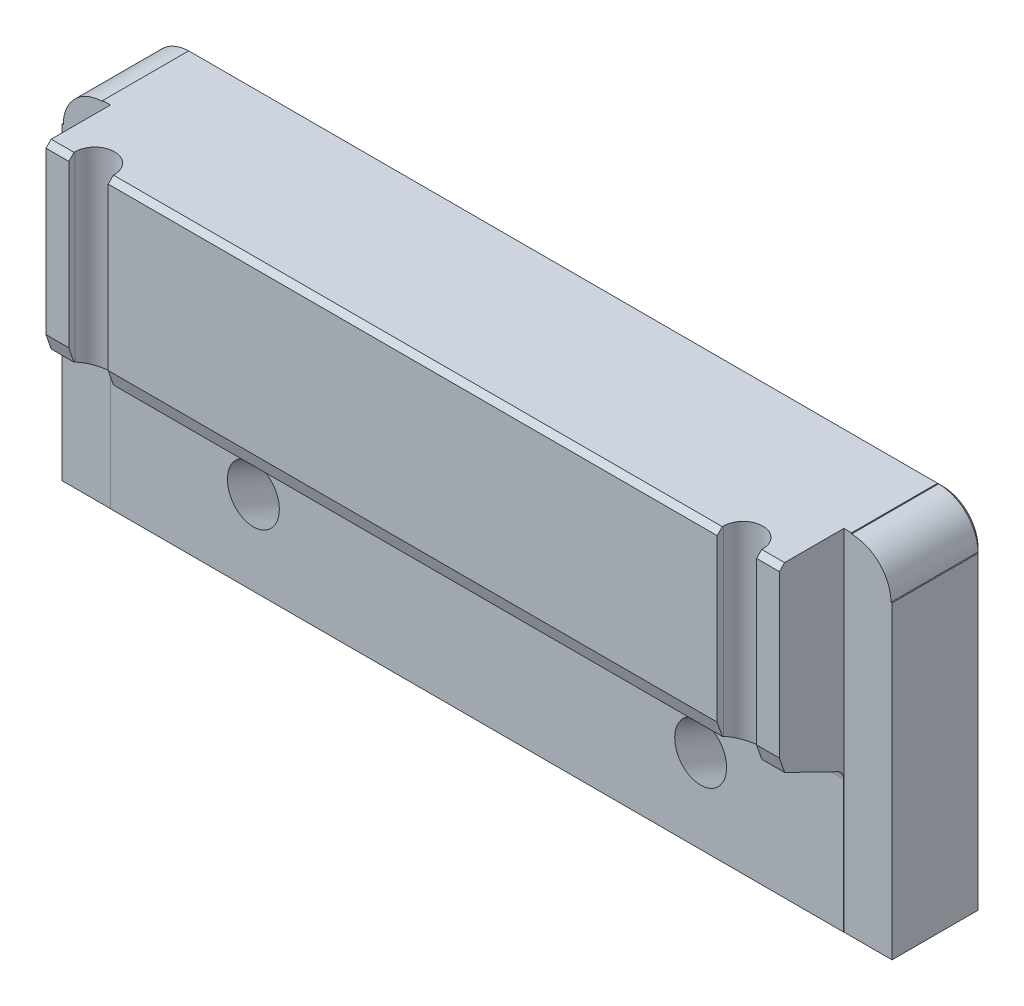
ISO-10303-21;
HEADER;
FILE_DESCRIPTION(('STEP AP214'),'2;1');
FILE_NAME('part.step','',(''),(''),'','','');
FILE_SCHEMA(('AUTOMOTIVE_DESIGN { 1 0 10303 214 1 1 1 1 }'));
ENDSEC;
DATA;
#1=APPLICATION_CONTEXT('core data for automotive mechanical design processes');
#2=APPLICATION_PROTOCOL_DEFINITION('international standard','automotive_design',2000,#1);
#3=PRODUCT_CONTEXT('',#1,'mechanical');
#4=PRODUCT('Part','Part','',(#3));
#5=PRODUCT_RELATED_PRODUCT_CATEGORY('part','',(#4));
#6=PRODUCT_DEFINITION_FORMATION('','',#4);
#7=PRODUCT_DEFINITION_CONTEXT('part definition',#1,'design');
#8=PRODUCT_DEFINITION('design','',#6,#7);
#9=PRODUCT_DEFINITION_SHAPE('','',#8);
#10=(LENGTH_UNIT() NAMED_UNIT(*) SI_UNIT(.MILLI.,.METRE.));
#11=(NAMED_UNIT(*) PLANE_ANGLE_UNIT() SI_UNIT($,.RADIAN.));
#12=(NAMED_UNIT(*) SI_UNIT($,.STERADIAN.) SOLID_ANGLE_UNIT());
#13=UNCERTAINTY_MEASURE_WITH_UNIT(LENGTH_MEASURE(1.E-05),#10,'distance_accuracy_value','');
#14=(GEOMETRIC_REPRESENTATION_CONTEXT(3) GLOBAL_UNCERTAINTY_ASSIGNED_CONTEXT((#13)) GLOBAL_UNIT_ASSIGNED_CONTEXT((#10,
#11,#12)) REPRESENTATION_CONTEXT('',''));
#15=CARTESIAN_POINT('',(0.,0.,0.));
#16=DIRECTION('',(0.,0.,1.));
#17=DIRECTION('',(1.,0.,0.));
#18=AXIS2_PLACEMENT_3D('',#15,#16,#17);
#19=CARTESIAN_POINT('',(101.5873,42.799,0.));
#20=DIRECTION('',(0.,0.,1.));
#21=DIRECTION('',(1.,0.,0.));
#22=AXIS2_PLACEMENT_3D('',#19,#20,#21);
#23=PLANE('',#22);
#24=CARTESIAN_POINT('',(83.82,-32.512,0.));
#25=DIRECTION('',(0.,0.,-1.));
#26=DIRECTION('',(-1.,0.,0.));
#27=AXIS2_PLACEMENT_3D('',#24,#25,#26);
#28=CIRCLE('',#27,3.96875);
#29=CARTESIAN_POINT('',(79.85125,-32.512,0.));
#30=VERTEX_POINT('',#29);
#31=EDGE_CURVE('E283',#30,#30,#28,.T.);
#32=ORIENTED_EDGE('',*,*,#31,.F.);
#33=EDGE_LOOP('',(#32));
#34=FACE_BOUND('',#33,.T.);
#35=DIRECTION('',(1.,0.,0.));
#36=VECTOR('',#35,1.);
#37=CARTESIAN_POINT('',(101.5873,41.529,0.));
#38=LINE('',#37,#36);
#39=CARTESIAN_POINT('',(-91.6813,41.529,0.));
#40=VERTEX_POINT('',#39);
#41=CARTESIAN_POINT('',(91.6813,41.529,0.));
#42=VERTEX_POINT('',#41);
#43=EDGE_CURVE('E620',#40,#42,#38,.T.);
#44=ORIENTED_EDGE('',*,*,#43,.T.);
#45=CARTESIAN_POINT('',(91.6813,32.893,0.));
#46=DIRECTION('',(0.,0.,1.));
#47=DIRECTION('',(1.,0.,0.));
#48=AXIS2_PLACEMENT_3D('',#45,#46,#47);
#49=CIRCLE('',#48,8.636);
#50=CARTESIAN_POINT('',(100.3173,32.893,0.));
#51=VERTEX_POINT('',#50);
#52=EDGE_CURVE('E640',#42,#51,#49,.F.);
#53=ORIENTED_EDGE('',*,*,#52,.T.);
#54=DIRECTION('',(0.,-1.,0.));
#55=VECTOR('',#54,1.);
#56=CARTESIAN_POINT('',(100.3173,42.799,0.));
#57=LINE('',#56,#55);
#58=CARTESIAN_POINT('',(100.3173,-41.529,0.));
#59=VERTEX_POINT('',#58);
#60=EDGE_CURVE('E614',#51,#59,#57,.T.);
#61=ORIENTED_EDGE('',*,*,#60,.T.);
#62=DIRECTION('',(-1.,0.,0.));
#63=VECTOR('',#62,1.);
#64=CARTESIAN_POINT('',(101.5873,-41.529,0.));
#65=LINE('',#64,#63);
#66=CARTESIAN_POINT('',(-100.3173,-41.529,0.));
#67=VERTEX_POINT('',#66);
#68=EDGE_CURVE('E616',#59,#67,#65,.T.);
#69=ORIENTED_EDGE('',*,*,#68,.T.);
#70=DIRECTION('',(0.,1.,0.));
#71=VECTOR('',#70,1.);
#72=CARTESIAN_POINT('',(-100.3173,32.893,0.));
#73=LINE('',#72,#71);
#74=CARTESIAN_POINT('',(-100.3173,32.893,0.));
#75=VERTEX_POINT('',#74);
#76=EDGE_CURVE('E618',#67,#75,#73,.T.);
#77=ORIENTED_EDGE('',*,*,#76,.T.);
#78=CARTESIAN_POINT('',(-91.6813,32.893,0.));
#79=DIRECTION('',(0.,0.,1.));
#80=DIRECTION('',(1.,0.,0.));
#81=AXIS2_PLACEMENT_3D('',#78,#79,#80);
#82=CIRCLE('',#81,8.636);
#83=EDGE_CURVE('E636',#75,#40,#82,.F.);
#84=ORIENTED_EDGE('',*,*,#83,.T.);
#85=EDGE_LOOP('',(#44,#53,#61,#69,#77,#84));
#86=FACE_BOUND('',#85,.T.);
#87=CARTESIAN_POINT('',(54.7624,-31.7246,0.));
#88=DIRECTION('',(0.,0.,1.));
#89=DIRECTION('',(0.,-1.,0.));
#90=AXIS2_PLACEMENT_3D('',#87,#88,#89);
#91=ELLIPSE('',#90,9.51977598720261,8.763);
#92=CARTESIAN_POINT('',(54.7624,-41.2443759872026,0.));
#93=VERTEX_POINT('',#92);
#94=EDGE_CURVE('E401',#93,#93,#91,.T.);
#95=ORIENTED_EDGE('',*,*,#94,.T.);
#96=EDGE_LOOP('',(#95));
#97=FACE_BOUND('',#96,.T.);
#98=CARTESIAN_POINT('',(-54.7624,-31.7246,0.));
#99=DIRECTION('',(0.,0.,1.));
#100=DIRECTION('',(0.,-1.,0.));
#101=AXIS2_PLACEMENT_3D('',#98,#99,#100);
#102=ELLIPSE('',#101,9.51977598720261,8.763);
#103=CARTESIAN_POINT('',(-54.7624,-41.2443759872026,0.));
#104=VERTEX_POINT('',#103);
#105=EDGE_CURVE('E393',#104,#104,#102,.T.);
#106=ORIENTED_EDGE('',*,*,#105,.T.);
#107=EDGE_LOOP('',(#106));
#108=FACE_BOUND('',#107,.T.);
#109=CARTESIAN_POINT('',(0.,0.,0.));
#110=DIRECTION('',(0.,0.,-1.));
#111=DIRECTION('',(-1.,0.,0.));
#112=AXIS2_PLACEMENT_3D('',#109,#110,#111);
#113=CIRCLE('',#112,3.96875);
#114=CARTESIAN_POINT('',(-3.96875,0.,0.));
#115=VERTEX_POINT('',#114);
#116=EDGE_CURVE('E379',#115,#115,#113,.T.);
#117=ORIENTED_EDGE('',*,*,#116,.F.);
#118=EDGE_LOOP('',(#117));
#119=FACE_BOUND('',#118,.T.);
#120=CARTESIAN_POINT('',(-83.82,0.,0.));
#121=DIRECTION('',(0.,0.,-1.));
#122=DIRECTION('',(-1.,0.,0.));
#123=AXIS2_PLACEMENT_3D('',#120,#121,#122);
#124=CIRCLE('',#123,3.96875);
#125=CARTESIAN_POINT('',(-87.78875,0.,0.));
#126=VERTEX_POINT('',#125);
#127=EDGE_CURVE('E367',#126,#126,#124,.T.);
#128=ORIENTED_EDGE('',*,*,#127,.F.);
#129=EDGE_LOOP('',(#128));
#130=FACE_BOUND('',#129,.T.);
#131=CARTESIAN_POINT('',(83.82,0.,0.));
#132=DIRECTION('',(0.,0.,-1.));
#133=DIRECTION('',(-1.,0.,0.));
#134=AXIS2_PLACEMENT_3D('',#131,#132,#133);
#135=CIRCLE('',#134,3.96875);
#136=CARTESIAN_POINT('',(79.85125,0.,0.));
#137=VERTEX_POINT('',#136);
#138=EDGE_CURVE('E355',#137,#137,#135,.T.);
#139=ORIENTED_EDGE('',*,*,#138,.F.);
#140=EDGE_LOOP('',(#139));
#141=FACE_BOUND('',#140,.T.);
#142=CARTESIAN_POINT('',(-83.82,32.512,0.));
#143=DIRECTION('',(0.,0.,-1.));
#144=DIRECTION('',(-1.,0.,0.));
#145=AXIS2_PLACEMENT_3D('',#142,#143,#144);
#146=CIRCLE('',#145,3.96875);
#147=CARTESIAN_POINT('',(-87.78875,32.512,0.));
#148=VERTEX_POINT('',#147);
#149=EDGE_CURVE('E343',#148,#148,#146,.T.);
#150=ORIENTED_EDGE('',*,*,#149,.F.);
#151=EDGE_LOOP('',(#150));
#152=FACE_BOUND('',#151,.T.);
#153=CARTESIAN_POINT('',(-83.82,-32.512,0.));
#154=DIRECTION('',(0.,0.,-1.));
#155=DIRECTION('',(-1.,0.,0.));
#156=AXIS2_PLACEMENT_3D('',#153,#154,#155);
#157=CIRCLE('',#156,3.96875);
#158=CARTESIAN_POINT('',(-87.78875,-32.512,0.));
#159=VERTEX_POINT('',#158);
#160=EDGE_CURVE('E331',#159,#159,#157,.T.);
#161=ORIENTED_EDGE('',*,*,#160,.F.);
#162=EDGE_LOOP('',(#161));
#163=FACE_BOUND('',#162,.T.);
#164=CARTESIAN_POINT('',(0.,-32.512,0.));
#165=DIRECTION('',(0.,0.,-1.));
#166=DIRECTION('',(-1.,0.,0.));
#167=AXIS2_PLACEMENT_3D('',#164,#165,#166);
#168=CIRCLE('',#167,3.96875);
#169=CARTESIAN_POINT('',(-3.96875,-32.512,0.));
#170=VERTEX_POINT('',#169);
#171=EDGE_CURVE('E319',#170,#170,#168,.T.);
#172=ORIENTED_EDGE('',*,*,#171,.F.);
#173=EDGE_LOOP('',(#172));
#174=FACE_BOUND('',#173,.T.);
#175=CARTESIAN_POINT('',(0.,32.512,0.));
#176=DIRECTION('',(0.,0.,-1.));
#177=DIRECTION('',(-1.,0.,0.));
#178=AXIS2_PLACEMENT_3D('',#175,#176,#177);
#179=CIRCLE('',#178,3.96875);
#180=CARTESIAN_POINT('',(-3.96875,32.512,0.));
#181=VERTEX_POINT('',#180);
#182=EDGE_CURVE('E307',#181,#181,#179,.T.);
#183=ORIENTED_EDGE('',*,*,#182,.F.);
#184=EDGE_LOOP('',(#183));
#185=FACE_BOUND('',#184,.T.);
#186=CARTESIAN_POINT('',(83.82,32.512,0.));
#187=DIRECTION('',(0.,0.,-1.));
#188=DIRECTION('',(-1.,0.,0.));
#189=AXIS2_PLACEMENT_3D('',#186,#187,#188);
#190=CIRCLE('',#189,3.96875);
#191=CARTESIAN_POINT('',(79.85125,32.512,0.));
#192=VERTEX_POINT('',#191);
#193=EDGE_CURVE('E295',#192,#192,#190,.T.);
#194=ORIENTED_EDGE('',*,*,#193,.F.);
#195=EDGE_LOOP('',(#194));
#196=FACE_BOUND('',#195,.T.);
#197=ADVANCED_FACE('F15',(#34,#86,#97,#108,#119,#130,#141,#152,#163,#174,#185,#196),#23,.F.);
#198=CARTESIAN_POINT('',(101.5873,1.98750960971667,38.1));
#199=DIRECTION('',(0.,0.,-1.));
#200=DIRECTION('',(-1.,0.,0.));
#201=AXIS2_PLACEMENT_3D('',#198,#199,#200);
#202=PLANE('',#201);
#203=DIRECTION('',(0.,-1.,0.));
#204=VECTOR('',#203,1.);
#205=CARTESIAN_POINT('',(-84.201,1.98750960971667,38.1));
#206=LINE('',#205,#204);
#207=CARTESIAN_POINT('',(-84.201,41.529,38.1));
#208=VERTEX_POINT('',#207);
#209=CARTESIAN_POINT('',(-84.201,1.98750960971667,38.1));
#210=VERTEX_POINT('',#209);
#211=EDGE_CURVE('E418',#208,#210,#206,.T.);
#212=ORIENTED_EDGE('',*,*,#211,.F.);
#213=DIRECTION('',(-1.,0.,0.));
#214=VECTOR('',#213,1.);
#215=CARTESIAN_POINT('',(101.5873,41.529,38.1));
#216=LINE('',#215,#214);
#217=CARTESIAN_POINT('',(-89.789,41.529,38.1));
#218=VERTEX_POINT('',#217);
#219=EDGE_CURVE('E604',#208,#218,#216,.T.);
#220=ORIENTED_EDGE('',*,*,#219,.T.);
#221=DIRECTION('',(0.,-1.,0.));
#222=VECTOR('',#221,1.);
#223=CARTESIAN_POINT('',(-89.789,64.3746517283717,38.1));
#224=LINE('',#223,#222);
#225=CARTESIAN_POINT('',(-89.789,1.98750960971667,38.1));
#226=VERTEX_POINT('',#225);
#227=EDGE_CURVE('E463',#218,#226,#224,.T.);
#228=ORIENTED_EDGE('',*,*,#227,.T.);
#229=DIRECTION('',(-1.,0.,0.));
#230=VECTOR('',#229,1.);
#231=CARTESIAN_POINT('',(101.5873,1.98750960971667,38.1));
#232=LINE('',#231,#230);
#233=EDGE_CURVE('E517',#210,#226,#232,.T.);
#234=ORIENTED_EDGE('',*,*,#233,.F.);
#235=EDGE_LOOP('',(#212,#220,#228,#234));
#236=FACE_BOUND('',#235,.T.);
#237=ADVANCED_FACE('F770',(#236),#202,.F.);
#238=DIRECTION('',(0.,1.,0.));
#239=VECTOR('',#238,1.);
#240=CARTESIAN_POINT('',(74.549,1.98750960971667,38.1));
#241=LINE('',#240,#239);
#242=CARTESIAN_POINT('',(74.549,1.98750960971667,38.1));
#243=VERTEX_POINT('',#242);
#244=CARTESIAN_POINT('',(74.549,41.529,38.1));
#245=VERTEX_POINT('',#244);
#246=EDGE_CURVE('E441',#243,#245,#241,.T.);
#247=ORIENTED_EDGE('',*,*,#246,.T.);
#248=DIRECTION('',(-1.,0.,0.));
#249=VECTOR('',#248,1.);
#250=CARTESIAN_POINT('',(101.5873,41.529,38.1));
#251=LINE('',#250,#249);
#252=CARTESIAN_POINT('',(-74.549,41.529,38.1));
#253=VERTEX_POINT('',#252);
#254=EDGE_CURVE('E597',#245,#253,#251,.T.);
#255=ORIENTED_EDGE('',*,*,#254,.T.);
#256=DIRECTION('',(0.,1.,0.));
#257=VECTOR('',#256,1.);
#258=CARTESIAN_POINT('',(-74.549,1.98750960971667,38.1));
#259=LINE('',#258,#257);
#260=CARTESIAN_POINT('',(-74.549,1.98750960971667,38.1));
#261=VERTEX_POINT('',#260);
#262=EDGE_CURVE('E413',#261,#253,#259,.T.);
#263=ORIENTED_EDGE('',*,*,#262,.F.);
#264=EDGE_CURVE('E523',#243,#261,#232,.T.);
#265=ORIENTED_EDGE('',*,*,#264,.F.);
#266=EDGE_LOOP('',(#247,#255,#263,#265));
#267=FACE_BOUND('',#266,.T.);
#268=ADVANCED_FACE('F776',(#267),#202,.F.);
#269=CARTESIAN_POINT('',(101.5873,-1.70083820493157,36.83));
#270=DIRECTION('',(0.,0.325568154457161,-0.945518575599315));
#271=DIRECTION('',(0.,0.945518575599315,0.325568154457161));
#272=AXIS2_PLACEMENT_3D('',#269,#270,#271);
#273=PLANE('',#272);
#274=DIRECTION('',(0.,-0.945518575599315,-0.325568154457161));
#275=VECTOR('',#274,1.);
#276=CARTESIAN_POINT('',(-84.201,-1.70083820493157,36.83));
#277=LINE('',#276,#275);
#278=CARTESIAN_POINT('',(-84.201,-1.70083820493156,36.83));
#279=VERTEX_POINT('',#278);
#280=EDGE_CURVE('E416',#210,#279,#277,.T.);
#281=ORIENTED_EDGE('',*,*,#280,.F.);
#282=ORIENTED_EDGE('',*,*,#233,.T.);
#283=DIRECTION('',(0.,0.945518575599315,0.325568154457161));
#284=VECTOR('',#283,1.);
#285=CARTESIAN_POINT('',(-89.789,-1.70083820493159,36.83));
#286=LINE('',#285,#284);
#287=CARTESIAN_POINT('',(-89.789,-1.70083820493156,36.83));
#288=VERTEX_POINT('',#287);
#289=EDGE_CURVE('E499',#288,#226,#286,.T.);
#290=ORIENTED_EDGE('',*,*,#289,.F.);
#291=DIRECTION('',(-1.,0.,0.));
#292=VECTOR('',#291,1.);
#293=CARTESIAN_POINT('',(101.5873,-1.70083820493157,36.83));
#294=LINE('',#293,#292);
#295=EDGE_CURVE('E513',#279,#288,#294,.T.);
#296=ORIENTED_EDGE('',*,*,#295,.F.);
#297=EDGE_LOOP('',(#281,#282,#290,#296));
#298=FACE_BOUND('',#297,.T.);
#299=ADVANCED_FACE('F791',(#298),#273,.F.);
#300=DIRECTION('',(0.,0.945518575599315,0.325568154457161));
#301=VECTOR('',#300,1.);
#302=CARTESIAN_POINT('',(-74.549,-1.70083820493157,36.83));
#303=LINE('',#302,#301);
#304=CARTESIAN_POINT('',(-74.549,-1.70083820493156,36.83));
#305=VERTEX_POINT('',#304);
#306=EDGE_CURVE('E410',#305,#261,#303,.T.);
#307=ORIENTED_EDGE('',*,*,#306,.F.);
#308=CARTESIAN_POINT('',(74.549,-1.70083820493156,36.83));
#309=VERTEX_POINT('',#308);
#310=EDGE_CURVE('E518',#309,#305,#294,.T.);
#311=ORIENTED_EDGE('',*,*,#310,.F.);
#312=DIRECTION('',(0.,0.945518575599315,0.325568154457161));
#313=VECTOR('',#312,1.);
#314=CARTESIAN_POINT('',(74.549,-1.70083820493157,36.83));
#315=LINE('',#314,#313);
#316=EDGE_CURVE('E438',#309,#243,#315,.T.);
#317=ORIENTED_EDGE('',*,*,#316,.T.);
#318=ORIENTED_EDGE('',*,*,#264,.T.);
#319=EDGE_LOOP('',(#307,#311,#317,#318));
#320=FACE_BOUND('',#319,.T.);
#321=ADVANCED_FACE('F792',(#320),#273,.F.);
#322=CARTESIAN_POINT('',(101.5873,42.799,38.1));
#323=DIRECTION('',(0.,-1.,0.));
#324=DIRECTION('',(0.,0.,-1.));
#325=AXIS2_PLACEMENT_3D('',#322,#323,#324);
#326=PLANE('',#325);
#327=DIRECTION('',(0.,0.,-1.));
#328=VECTOR('',#327,1.);
#329=CARTESIAN_POINT('',(84.201,42.799,36.576));
#330=LINE('',#329,#328);
#331=CARTESIAN_POINT('',(84.201,42.799,36.83));
#332=VERTEX_POINT('',#331);
#333=CARTESIAN_POINT('',(84.201,42.799,36.576));
#334=VERTEX_POINT('',#333);
#335=EDGE_CURVE('E420',#332,#334,#330,.T.);
#336=ORIENTED_EDGE('',*,*,#335,.F.);
#337=DIRECTION('',(1.,0.,0.));
#338=VECTOR('',#337,1.);
#339=CARTESIAN_POINT('',(101.5873,42.799,36.83));
#340=LINE('',#339,#338);
#341=CARTESIAN_POINT('',(89.789,42.799,36.83));
#342=VERTEX_POINT('',#341);
#343=EDGE_CURVE('E593',#332,#342,#340,.T.);
#344=ORIENTED_EDGE('',*,*,#343,.T.);
#345=DIRECTION('',(0.,0.,1.));
#346=VECTOR('',#345,1.);
#347=CARTESIAN_POINT('',(89.789,42.799,38.1));
#348=LINE('',#347,#346);
#349=CARTESIAN_POINT('',(89.789,42.799,22.3266));
#350=VERTEX_POINT('',#349);
#351=EDGE_CURVE('E491',#350,#342,#348,.T.);
#352=ORIENTED_EDGE('',*,*,#351,.F.);
#353=DIRECTION('',(-1.,0.,0.));
#354=VECTOR('',#353,1.);
#355=CARTESIAN_POINT('',(101.5873,42.799,22.3266));
#356=LINE('',#355,#354);
#357=CARTESIAN_POINT('',(91.6813,42.799,22.3266));
#358=VERTEX_POINT('',#357);
#359=EDGE_CURVE('E481',#358,#350,#356,.T.);
#360=ORIENTED_EDGE('',*,*,#359,.F.);
#361=DIRECTION('',(0.,0.,-1.));
#362=VECTOR('',#361,1.);
#363=CARTESIAN_POINT('',(91.6813,42.799,38.1));
#364=LINE('',#363,#362);
#365=CARTESIAN_POINT('',(91.6813,42.799,1.26999999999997));
#366=VERTEX_POINT('',#365);
#367=EDGE_CURVE('E457',#358,#366,#364,.T.);
#368=ORIENTED_EDGE('',*,*,#367,.T.);
#369=DIRECTION('',(-1.,0.,0.));
#370=VECTOR('',#369,1.);
#371=CARTESIAN_POINT('',(101.5873,42.799,1.26999999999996));
#372=LINE('',#371,#370);
#373=CARTESIAN_POINT('',(-91.6813,42.799,1.26999999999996));
#374=VERTEX_POINT('',#373);
#375=EDGE_CURVE('E586',#366,#374,#372,.T.);
#376=ORIENTED_EDGE('',*,*,#375,.T.);
#377=DIRECTION('',(0.,0.,-1.));
#378=VECTOR('',#377,1.);
#379=CARTESIAN_POINT('',(-91.6813,42.799,38.1));
#380=LINE('',#379,#378);
#381=CARTESIAN_POINT('',(-91.6813,42.799,22.3266));
#382=VERTEX_POINT('',#381);
#383=EDGE_CURVE('E451',#382,#374,#380,.T.);
#384=ORIENTED_EDGE('',*,*,#383,.F.);
#385=CARTESIAN_POINT('',(-89.789,42.799,22.3266));
#386=VERTEX_POINT('',#385);
#387=EDGE_CURVE('E476',#386,#382,#356,.T.);
#388=ORIENTED_EDGE('',*,*,#387,.F.);
#389=DIRECTION('',(0.,0.,-1.));
#390=VECTOR('',#389,1.);
#391=CARTESIAN_POINT('',(-89.789,42.799,38.1));
#392=LINE('',#391,#390);
#393=CARTESIAN_POINT('',(-89.789,42.799,36.83));
#394=VERTEX_POINT('',#393);
#395=EDGE_CURVE('E502',#394,#386,#392,.T.);
#396=ORIENTED_EDGE('',*,*,#395,.F.);
#397=DIRECTION('',(1.,0.,0.));
#398=VECTOR('',#397,1.);
#399=CARTESIAN_POINT('',(101.5873,42.799,36.83));
#400=LINE('',#399,#398);
#401=CARTESIAN_POINT('',(-84.201,42.799,36.83));
#402=VERTEX_POINT('',#401);
#403=EDGE_CURVE('E589',#394,#402,#400,.T.);
#404=ORIENTED_EDGE('',*,*,#403,.T.);
#405=DIRECTION('',(0.,0.,-1.));
#406=VECTOR('',#405,1.);
#407=CARTESIAN_POINT('',(-84.201,42.799,36.576));
#408=LINE('',#407,#406);
#409=CARTESIAN_POINT('',(-84.201,42.799,36.576));
#410=VERTEX_POINT('',#409);
#411=EDGE_CURVE('E404',#402,#410,#408,.T.);
#412=ORIENTED_EDGE('',*,*,#411,.T.);
#413=CARTESIAN_POINT('',(-79.375,42.799,36.576));
#414=DIRECTION('',(0.,-1.,0.));
#415=DIRECTION('',(0.,0.,-1.));
#416=AXIS2_PLACEMENT_3D('',#413,#414,#415);
#417=CIRCLE('',#416,4.826);
#418=CARTESIAN_POINT('',(-74.549,42.799,36.576));
#419=VERTEX_POINT('',#418);
#420=EDGE_CURVE('E400',#410,#419,#417,.T.);
#421=ORIENTED_EDGE('',*,*,#420,.T.);
#422=DIRECTION('',(0.,0.,1.));
#423=VECTOR('',#422,1.);
#424=CARTESIAN_POINT('',(-74.549,42.799,56.3881036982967));
#425=LINE('',#424,#423);
#426=CARTESIAN_POINT('',(-74.549,42.799,36.83));
#427=VERTEX_POINT('',#426);
#428=EDGE_CURVE('E397',#419,#427,#425,.T.);
#429=ORIENTED_EDGE('',*,*,#428,.T.);
#430=DIRECTION('',(1.,0.,0.));
#431=VECTOR('',#430,1.);
#432=CARTESIAN_POINT('',(101.5873,42.799,36.83));
#433=LINE('',#432,#431);
#434=CARTESIAN_POINT('',(74.549,42.799,36.83));
#435=VERTEX_POINT('',#434);
#436=EDGE_CURVE('E591',#427,#435,#433,.T.);
#437=ORIENTED_EDGE('',*,*,#436,.T.);
#438=DIRECTION('',(0.,0.,1.));
#439=VECTOR('',#438,1.);
#440=CARTESIAN_POINT('',(74.549,42.799,56.3881036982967));
#441=LINE('',#440,#439);
#442=CARTESIAN_POINT('',(74.549,42.799,36.576));
#443=VERTEX_POINT('',#442);
#444=EDGE_CURVE('E425',#443,#435,#441,.T.);
#445=ORIENTED_EDGE('',*,*,#444,.F.);
#446=CARTESIAN_POINT('',(79.375,42.799,36.576));
#447=DIRECTION('',(0.,1.,0.));
#448=DIRECTION('',(0.,0.,-1.));
#449=AXIS2_PLACEMENT_3D('',#446,#447,#448);
#450=CIRCLE('',#449,4.826);
#451=EDGE_CURVE('E422',#334,#443,#450,.T.);
#452=ORIENTED_EDGE('',*,*,#451,.F.);
#453=EDGE_LOOP('',(#336,#344,#352,#360,#368,#376,#384,#388,#396,#404,#412,#421,#429,#437,#445,#452));
#454=FACE_BOUND('',#453,.T.);
#455=ADVANCED_FACE('F704',(#454),#326,.F.);
#456=CARTESIAN_POINT('',(101.5873,-8.762230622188,22.352));
#457=DIRECTION('',(0.,0.89879404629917,-0.438371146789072));
#458=DIRECTION('',(0.,0.438371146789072,0.89879404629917));
#459=AXIS2_PLACEMENT_3D('',#456,#457,#458);
#460=PLANE('',#459);
#461=DIRECTION('',(0.,0.438371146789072,0.89879404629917));
#462=VECTOR('',#461,1.);
#463=CARTESIAN_POINT('',(-89.789,-8.762230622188,22.352));
#464=LINE('',#463,#462);
#465=CARTESIAN_POINT('',(-89.789,-8.06646189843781,23.7785372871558));
#466=VERTEX_POINT('',#465);
#467=EDGE_CURVE('E497',#466,#288,#464,.T.);
#468=ORIENTED_EDGE('',*,*,#467,.F.);
#469=DIRECTION('',(-1.,0.,0.));
#470=VECTOR('',#469,1.);
#471=CARTESIAN_POINT('',(89.789,-8.06646189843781,23.7785372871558));
#472=LINE('',#471,#470);
#473=CARTESIAN_POINT('',(89.789,-8.06646189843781,23.7785372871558));
#474=VERTEX_POINT('',#473);
#475=EDGE_CURVE('E567',#466,#474,#472,.F.);
#476=ORIENTED_EDGE('',*,*,#475,.T.);
#477=DIRECTION('',(0.,-0.438371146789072,-0.89879404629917));
#478=VECTOR('',#477,1.);
#479=CARTESIAN_POINT('',(89.789,-8.762230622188,22.352));
#480=LINE('',#479,#478);
#481=CARTESIAN_POINT('',(89.789,-1.70083820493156,36.83));
#482=VERTEX_POINT('',#481);
#483=EDGE_CURVE('E486',#482,#474,#480,.T.);
#484=ORIENTED_EDGE('',*,*,#483,.F.);
#485=CARTESIAN_POINT('',(84.201,-1.70083820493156,36.83));
#486=VERTEX_POINT('',#485);
#487=EDGE_CURVE('E514',#482,#486,#294,.T.);
#488=ORIENTED_EDGE('',*,*,#487,.T.);
#489=DIRECTION('',(0.,-0.438371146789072,-0.89879404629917));
#490=VECTOR('',#489,1.);
#491=CARTESIAN_POINT('',(84.201,-8.762230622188,22.352));
#492=LINE('',#491,#490);
#493=CARTESIAN_POINT('',(84.201,-1.82472228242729,36.576));
#494=VERTEX_POINT('',#493);
#495=EDGE_CURVE('E548',#486,#494,#492,.T.);
#496=ORIENTED_EDGE('',*,*,#495,.T.);
#497=CARTESIAN_POINT('',(79.375,-1.8247222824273,36.576));
#498=DIRECTION('',(0.,0.89879404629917,-0.438371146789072));
#499=DIRECTION('',(0.,0.438371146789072,0.89879404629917));
#500=AXIS2_PLACEMENT_3D('',#497,#498,#499);
#501=ELLIPSE('',#500,5.36941696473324,4.826);
#502=CARTESIAN_POINT('',(74.549,-1.8247222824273,36.576));
#503=VERTEX_POINT('',#502);
#504=EDGE_CURVE('E551',#494,#503,#501,.T.);
#505=ORIENTED_EDGE('',*,*,#504,.T.);
#506=DIRECTION('',(0.,0.438371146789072,0.89879404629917));
#507=VECTOR('',#506,1.);
#508=CARTESIAN_POINT('',(74.549,-8.762230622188,22.352));
#509=LINE('',#508,#507);
#510=EDGE_CURVE('E554',#503,#309,#509,.T.);
#511=ORIENTED_EDGE('',*,*,#510,.T.);
#512=ORIENTED_EDGE('',*,*,#310,.T.);
#513=DIRECTION('',(0.,0.438371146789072,0.89879404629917));
#514=VECTOR('',#513,1.);
#515=CARTESIAN_POINT('',(-74.549,-8.762230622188,22.352));
#516=LINE('',#515,#514);
#517=CARTESIAN_POINT('',(-74.549,-1.82472228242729,36.576));
#518=VERTEX_POINT('',#517);
#519=EDGE_CURVE('E557',#518,#305,#516,.T.);
#520=ORIENTED_EDGE('',*,*,#519,.F.);
#521=CARTESIAN_POINT('',(-79.375,-1.8247222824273,36.576));
#522=DIRECTION('',(0.,0.89879404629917,-0.438371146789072));
#523=DIRECTION('',(0.,0.438371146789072,0.89879404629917));
#524=AXIS2_PLACEMENT_3D('',#521,#522,#523);
#525=ELLIPSE('',#524,5.36941696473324,4.826);
#526=CARTESIAN_POINT('',(-84.201,-1.8247222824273,36.576));
#527=VERTEX_POINT('',#526);
#528=EDGE_CURVE('E559',#527,#518,#525,.F.);
#529=ORIENTED_EDGE('',*,*,#528,.F.);
#530=DIRECTION('',(0.,-0.438371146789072,-0.89879404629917));
#531=VECTOR('',#530,1.);
#532=CARTESIAN_POINT('',(-84.201,-8.762230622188,22.352));
#533=LINE('',#532,#531);
#534=EDGE_CURVE('E562',#279,#527,#533,.T.);
#535=ORIENTED_EDGE('',*,*,#534,.F.);
#536=ORIENTED_EDGE('',*,*,#295,.T.);
#537=EDGE_LOOP('',(#468,#476,#484,#488,#496,#505,#511,#512,#520,#529,#535,#536));
#538=FACE_BOUND('',#537,.T.);
#539=ADVANCED_FACE('F722',(#538),#460,.F.);
#540=CARTESIAN_POINT('',(-101.5873,42.799,0.));
#541=DIRECTION('',(-1.,0.,0.));
#542=DIRECTION('',(0.,0.,1.));
#543=AXIS2_PLACEMENT_3D('',#540,#541,#542);
#544=PLANE('',#543);
#545=DIRECTION('',(0.,0.,-1.));
#546=VECTOR('',#545,1.);
#547=CARTESIAN_POINT('',(-101.5873,32.893,0.));
#548=LINE('',#547,#546);
#549=CARTESIAN_POINT('',(-101.5873,32.893,22.3266));
#550=VERTEX_POINT('',#549);
#551=CARTESIAN_POINT('',(-101.5873,32.893,1.26999999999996));
#552=VERTEX_POINT('',#551);
#553=EDGE_CURVE('E447',#550,#552,#548,.T.);
#554=ORIENTED_EDGE('',*,*,#553,.T.);
#555=DIRECTION('',(0.,-1.,0.));
#556=VECTOR('',#555,1.);
#557=CARTESIAN_POINT('',(-101.5873,-42.799,1.26999999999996));
#558=LINE('',#557,#556);
#559=CARTESIAN_POINT('',(-101.5873,-42.799,1.26999999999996));
#560=VERTEX_POINT('',#559);
#561=EDGE_CURVE('E627',#552,#560,#558,.T.);
#562=ORIENTED_EDGE('',*,*,#561,.T.);
#563=DIRECTION('',(0.,0.,-1.));
#564=VECTOR('',#563,1.);
#565=CARTESIAN_POINT('',(-101.5873,-42.799,0.));
#566=LINE('',#565,#564);
#567=CARTESIAN_POINT('',(-101.5873,-42.799,22.3266));
#568=VERTEX_POINT('',#567);
#569=EDGE_CURVE('E504',#568,#560,#566,.T.);
#570=ORIENTED_EDGE('',*,*,#569,.F.);
#571=DIRECTION('',(0.,1.,0.));
#572=VECTOR('',#571,1.);
#573=CARTESIAN_POINT('',(-101.5873,42.799,22.3266));
#574=LINE('',#573,#572);
#575=EDGE_CURVE('E522',#568,#550,#574,.T.);
#576=ORIENTED_EDGE('',*,*,#575,.T.);
#577=EDGE_LOOP('',(#554,#562,#570,#576));
#578=FACE_BOUND('',#577,.T.);
#579=ADVANCED_FACE('F665',(#578),#544,.T.);
#580=CARTESIAN_POINT('',(0.,3.16521253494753,22.3266));
#581=DIRECTION('',(0.,0.,1.));
#582=DIRECTION('',(1.,0.,0.));
#583=AXIS2_PLACEMENT_3D('',#580,#581,#582);
#584=PLANE('',#583);
#585=ORIENTED_EDGE('',*,*,#387,.T.);
#586=DIRECTION('',(0.,-1.,0.));
#587=VECTOR('',#586,1.);
#588=CARTESIAN_POINT('',(-91.6813,3.16521253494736,22.3266));
#589=LINE('',#588,#587);
#590=CARTESIAN_POINT('',(-91.6813,42.545,22.3266));
#591=VERTEX_POINT('',#590);
#592=EDGE_CURVE('E545',#382,#591,#589,.T.);
#593=ORIENTED_EDGE('',*,*,#592,.T.);
#594=CARTESIAN_POINT('',(-91.6813,32.893,22.3266));
#595=DIRECTION('',(0.,0.,1.));
#596=DIRECTION('',(1.,0.,0.));
#597=AXIS2_PLACEMENT_3D('',#594,#595,#596);
#598=CIRCLE('',#597,9.652);
#599=CARTESIAN_POINT('',(-101.3333,32.893,22.3266));
#600=VERTEX_POINT('',#599);
#601=EDGE_CURVE('E542',#591,#600,#598,.T.);
#602=ORIENTED_EDGE('',*,*,#601,.T.);
#603=DIRECTION('',(-1.,0.,0.));
#604=VECTOR('',#603,1.);
#605=CARTESIAN_POINT('',(0.,32.893,22.3266));
#606=LINE('',#605,#604);
#607=EDGE_CURVE('E539',#600,#550,#606,.T.);
#608=ORIENTED_EDGE('',*,*,#607,.T.);
#609=ORIENTED_EDGE('',*,*,#575,.F.);
#610=DIRECTION('',(1.,0.,0.));
#611=VECTOR('',#610,1.);
#612=CARTESIAN_POINT('',(101.5873,-42.799,22.3266));
#613=LINE('',#612,#611);
#614=CARTESIAN_POINT('',(-89.789,-42.799,22.3266));
#615=VERTEX_POINT('',#614);
#616=EDGE_CURVE('E474',#568,#615,#613,.T.);
#617=ORIENTED_EDGE('',*,*,#616,.T.);
#618=DIRECTION('',(0.,-1.,0.));
#619=VECTOR('',#618,1.);
#620=CARTESIAN_POINT('',(-89.789,64.3746517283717,22.3266));
#621=LINE('',#620,#619);
#622=EDGE_CURVE('E468',#386,#615,#621,.T.);
#623=ORIENTED_EDGE('',*,*,#622,.F.);
#624=EDGE_LOOP('',(#585,#593,#602,#608,#609,#617,#623));
#625=FACE_BOUND('',#624,.T.);
#626=ADVANCED_FACE('F739',(#625),#584,.T.);
#627=DIRECTION('',(0.,1.,0.));
#628=VECTOR('',#627,1.);
#629=CARTESIAN_POINT('',(89.789,64.3746517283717,38.1));
#630=LINE('',#629,#628);
#631=CARTESIAN_POINT('',(89.789,1.98750960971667,38.1));
#632=VERTEX_POINT('',#631);
#633=CARTESIAN_POINT('',(89.789,41.529,38.1));
#634=VERTEX_POINT('',#633);
#635=EDGE_CURVE('E465',#632,#634,#630,.T.);
#636=ORIENTED_EDGE('',*,*,#635,.T.);
#637=DIRECTION('',(-1.,0.,0.));
#638=VECTOR('',#637,1.);
#639=CARTESIAN_POINT('',(101.5873,41.529,38.1));
#640=LINE('',#639,#638);
#641=CARTESIAN_POINT('',(84.201,41.529,38.1));
#642=VERTEX_POINT('',#641);
#643=EDGE_CURVE('E573',#634,#642,#640,.T.);
#644=ORIENTED_EDGE('',*,*,#643,.T.);
#645=DIRECTION('',(0.,-1.,0.));
#646=VECTOR('',#645,1.);
#647=CARTESIAN_POINT('',(84.201,1.98750960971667,38.1));
#648=LINE('',#647,#646);
#649=CARTESIAN_POINT('',(84.201,1.98750960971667,38.1));
#650=VERTEX_POINT('',#649);
#651=EDGE_CURVE('E436',#642,#650,#648,.T.);
#652=ORIENTED_EDGE('',*,*,#651,.T.);
#653=EDGE_CURVE('E519',#632,#650,#232,.T.);
#654=ORIENTED_EDGE('',*,*,#653,.F.);
#655=EDGE_LOOP('',(#636,#644,#652,#654));
#656=FACE_BOUND('',#655,.T.);
#657=ADVANCED_FACE('F712',(#656),#202,.F.);
#658=ORIENTED_EDGE('',*,*,#653,.T.);
#659=DIRECTION('',(0.,-0.945518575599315,-0.325568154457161));
#660=VECTOR('',#659,1.);
#661=CARTESIAN_POINT('',(84.201,-1.70083820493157,36.83));
#662=LINE('',#661,#660);
#663=EDGE_CURVE('E431',#650,#486,#662,.T.);
#664=ORIENTED_EDGE('',*,*,#663,.T.);
#665=ORIENTED_EDGE('',*,*,#487,.F.);
#666=DIRECTION('',(0.,-0.945518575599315,-0.325568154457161));
#667=VECTOR('',#666,1.);
#668=CARTESIAN_POINT('',(89.789,-1.70083820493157,36.83));
#669=LINE('',#668,#667);
#670=EDGE_CURVE('E489',#632,#482,#669,.T.);
#671=ORIENTED_EDGE('',*,*,#670,.F.);
#672=EDGE_LOOP('',(#658,#664,#665,#671));
#673=FACE_BOUND('',#672,.T.);
#674=ADVANCED_FACE('F716',(#673),#273,.F.);
#675=CARTESIAN_POINT('',(101.5873,-42.799,22.352));
#676=DIRECTION('',(0.,0.,-1.));
#677=DIRECTION('',(-1.,0.,0.));
#678=AXIS2_PLACEMENT_3D('',#675,#676,#677);
#679=PLANE('',#678);
#680=CARTESIAN_POINT('',(-54.7624,-22.2367389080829,22.352));
#681=DIRECTION('',(0.,0.,-1.));
#682=DIRECTION('',(0.,-1.,0.));
#683=AXIS2_PLACEMENT_3D('',#680,#681,#682);
#684=ELLIPSE('',#683,6.90528678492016,6.35635);
#685=CARTESIAN_POINT('',(-54.7624,-29.1420256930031,22.352));
#686=VERTEX_POINT('',#685);
#687=EDGE_CURVE('E388',#686,#686,#684,.T.);
#688=ORIENTED_EDGE('',*,*,#687,.T.);
#689=EDGE_LOOP('',(#688));
#690=FACE_BOUND('',#689,.T.);
#691=CARTESIAN_POINT('',(54.7624,-22.2367389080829,22.352));
#692=DIRECTION('',(0.,0.,-1.));
#693=DIRECTION('',(0.,-1.,0.));
#694=AXIS2_PLACEMENT_3D('',#691,#692,#693);
#695=ELLIPSE('',#694,6.90528678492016,6.35635);
#696=CARTESIAN_POINT('',(54.7624,-29.1420256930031,22.352));
#697=VERTEX_POINT('',#696);
#698=EDGE_CURVE('E396',#697,#697,#695,.T.);
#699=ORIENTED_EDGE('',*,*,#698,.T.);
#700=EDGE_LOOP('',(#699));
#701=FACE_BOUND('',#700,.T.);
#702=DIRECTION('',(0.,-1.,0.));
#703=VECTOR('',#702,1.);
#704=CARTESIAN_POINT('',(89.789,-42.799,22.352));
#705=LINE('',#704,#703);
#706=CARTESIAN_POINT('',(89.789,-10.3493987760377,22.352));
#707=VERTEX_POINT('',#706);
#708=CARTESIAN_POINT('',(89.789,-42.799,22.352));
#709=VERTEX_POINT('',#708);
#710=EDGE_CURVE('E484',#707,#709,#705,.T.);
#711=ORIENTED_EDGE('',*,*,#710,.F.);
#712=DIRECTION('',(-1.,0.,0.));
#713=VECTOR('',#712,1.);
#714=CARTESIAN_POINT('',(-89.789,-10.3493987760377,22.352));
#715=LINE('',#714,#713);
#716=CARTESIAN_POINT('',(-89.789,-10.3493987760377,22.352));
#717=VERTEX_POINT('',#716);
#718=EDGE_CURVE('E564',#707,#717,#715,.T.);
#719=ORIENTED_EDGE('',*,*,#718,.T.);
#720=DIRECTION('',(0.,1.,0.));
#721=VECTOR('',#720,1.);
#722=CARTESIAN_POINT('',(-89.789,-42.799,22.352));
#723=LINE('',#722,#721);
#724=CARTESIAN_POINT('',(-89.789,-42.799,22.352));
#725=VERTEX_POINT('',#724);
#726=EDGE_CURVE('E494',#725,#717,#723,.T.);
#727=ORIENTED_EDGE('',*,*,#726,.F.);
#728=DIRECTION('',(-1.,0.,0.));
#729=VECTOR('',#728,1.);
#730=CARTESIAN_POINT('',(101.5873,-42.799,22.352));
#731=LINE('',#730,#729);
#732=EDGE_CURVE('E508',#709,#725,#731,.T.);
#733=ORIENTED_EDGE('',*,*,#732,.F.);
#734=EDGE_LOOP('',(#711,#719,#727,#733));
#735=FACE_BOUND('',#734,.T.);
#736=ADVANCED_FACE('F730',(#690,#701,#735),#679,.F.);
#737=CARTESIAN_POINT('',(101.5873,-42.799,0.));
#738=DIRECTION('',(0.,1.,0.));
#739=DIRECTION('',(0.,0.,1.));
#740=AXIS2_PLACEMENT_3D('',#737,#738,#739);
#741=PLANE('',#740);
#742=ORIENTED_EDGE('',*,*,#569,.T.);
#743=DIRECTION('',(1.,0.,0.));
#744=VECTOR('',#743,1.);
#745=CARTESIAN_POINT('',(101.5873,-42.799,1.26999999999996));
#746=LINE('',#745,#744);
#747=CARTESIAN_POINT('',(101.5873,-42.799,1.26999999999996));
#748=VERTEX_POINT('',#747);
#749=EDGE_CURVE('E629',#560,#748,#746,.T.);
#750=ORIENTED_EDGE('',*,*,#749,.T.);
#751=DIRECTION('',(0.,0.,-1.));
#752=VECTOR('',#751,1.);
#753=CARTESIAN_POINT('',(101.5873,-42.799,0.));
#754=LINE('',#753,#752);
#755=CARTESIAN_POINT('',(101.5873,-42.799,22.3266));
#756=VERTEX_POINT('',#755);
#757=EDGE_CURVE('E505',#756,#748,#754,.T.);
#758=ORIENTED_EDGE('',*,*,#757,.F.);
#759=CARTESIAN_POINT('',(89.789,-42.799,22.3266));
#760=VERTEX_POINT('',#759);
#761=EDGE_CURVE('E477',#760,#756,#613,.T.);
#762=ORIENTED_EDGE('',*,*,#761,.F.);
#763=DIRECTION('',(0.,0.,-1.));
#764=VECTOR('',#763,1.);
#765=CARTESIAN_POINT('',(89.789,-42.799,0.));
#766=LINE('',#765,#764);
#767=EDGE_CURVE('E526',#709,#760,#766,.T.);
#768=ORIENTED_EDGE('',*,*,#767,.F.);
#769=ORIENTED_EDGE('',*,*,#732,.T.);
#770=DIRECTION('',(0.,0.,1.));
#771=VECTOR('',#770,1.);
#772=CARTESIAN_POINT('',(-89.789,-42.799,0.));
#773=LINE('',#772,#771);
#774=EDGE_CURVE('E528',#615,#725,#773,.T.);
#775=ORIENTED_EDGE('',*,*,#774,.F.);
#776=ORIENTED_EDGE('',*,*,#616,.F.);
#777=EDGE_LOOP('',(#742,#750,#758,#762,#768,#769,#775,#776));
#778=FACE_BOUND('',#777,.T.);
#779=ADVANCED_FACE('F669',(#778),#741,.F.);
#780=CARTESIAN_POINT('',(101.5873,42.799,0.));
#781=DIRECTION('',(-1.,0.,0.));
#782=DIRECTION('',(0.,0.,1.));
#783=AXIS2_PLACEMENT_3D('',#780,#781,#782);
#784=PLANE('',#783);
#785=ORIENTED_EDGE('',*,*,#757,.T.);
#786=DIRECTION('',(0.,1.,0.));
#787=VECTOR('',#786,1.);
#788=CARTESIAN_POINT('',(101.5873,42.799,1.26999999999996));
#789=LINE('',#788,#787);
#790=CARTESIAN_POINT('',(101.5873,32.893,1.26999999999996));
#791=VERTEX_POINT('',#790);
#792=EDGE_CURVE('E631',#748,#791,#789,.T.);
#793=ORIENTED_EDGE('',*,*,#792,.T.);
#794=DIRECTION('',(0.,0.,1.));
#795=VECTOR('',#794,1.);
#796=CARTESIAN_POINT('',(101.5873,32.893,0.));
#797=LINE('',#796,#795);
#798=CARTESIAN_POINT('',(101.5873,32.893,22.3266));
#799=VERTEX_POINT('',#798);
#800=EDGE_CURVE('E461',#791,#799,#797,.T.);
#801=ORIENTED_EDGE('',*,*,#800,.T.);
#802=DIRECTION('',(0.,1.,0.));
#803=VECTOR('',#802,1.);
#804=CARTESIAN_POINT('',(101.5873,42.799,22.3266));
#805=LINE('',#804,#803);
#806=EDGE_CURVE('E480',#756,#799,#805,.T.);
#807=ORIENTED_EDGE('',*,*,#806,.F.);
#808=EDGE_LOOP('',(#785,#793,#801,#807));
#809=FACE_BOUND('',#808,.T.);
#810=ADVANCED_FACE('F683',(#809),#784,.F.);
#811=CARTESIAN_POINT('',(-89.789,64.3746517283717,22.3266));
#812=DIRECTION('',(-1.,0.,0.));
#813=DIRECTION('',(0.,-1.,0.));
#814=AXIS2_PLACEMENT_3D('',#811,#812,#813);
#815=PLANE('',#814);
#816=ORIENTED_EDGE('',*,*,#227,.F.);
#817=DIRECTION('',(0.,-0.707106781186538,0.707106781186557));
#818=VECTOR('',#817,1.);
#819=CARTESIAN_POINT('',(-89.789,60.8385258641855,18.7904741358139));
#820=LINE('',#819,#818);
#821=EDGE_CURVE('E607',#218,#394,#820,.F.);
#822=ORIENTED_EDGE('',*,*,#821,.T.);
#823=ORIENTED_EDGE('',*,*,#395,.T.);
#824=ORIENTED_EDGE('',*,*,#622,.T.);
#825=ORIENTED_EDGE('',*,*,#774,.T.);
#826=ORIENTED_EDGE('',*,*,#726,.T.);
#827=CARTESIAN_POINT('',(-89.789,-10.3493987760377,24.892));
#828=DIRECTION('',(-1.,0.,0.));
#829=DIRECTION('',(0.,-1.,0.));
#830=AXIS2_PLACEMENT_3D('',#827,#828,#829);
#831=CIRCLE('',#830,2.54);
#832=EDGE_CURVE('E569',#717,#466,#831,.F.);
#833=ORIENTED_EDGE('',*,*,#832,.T.);
#834=ORIENTED_EDGE('',*,*,#467,.T.);
#835=ORIENTED_EDGE('',*,*,#289,.T.);
#836=EDGE_LOOP('',(#816,#822,#823,#824,#825,#826,#833,#834,#835));
#837=FACE_BOUND('',#836,.T.);
#838=ADVANCED_FACE('F734',(#837),#815,.T.);
#839=CARTESIAN_POINT('',(89.789,64.3746517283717,22.3266));
#840=DIRECTION('',(1.,0.,0.));
#841=DIRECTION('',(0.,1.,0.));
#842=AXIS2_PLACEMENT_3D('',#839,#840,#841);
#843=PLANE('',#842);
#844=ORIENTED_EDGE('',*,*,#351,.T.);
#845=DIRECTION('',(0.,0.707106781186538,-0.707106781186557));
#846=VECTOR('',#845,1.);
#847=CARTESIAN_POINT('',(89.789,60.8385258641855,18.7904741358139));
#848=LINE('',#847,#846);
#849=EDGE_CURVE('E595',#342,#634,#848,.F.);
#850=ORIENTED_EDGE('',*,*,#849,.T.);
#851=ORIENTED_EDGE('',*,*,#635,.F.);
#852=ORIENTED_EDGE('',*,*,#670,.T.);
#853=ORIENTED_EDGE('',*,*,#483,.T.);
#854=CARTESIAN_POINT('',(89.789,-10.3493987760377,24.892));
#855=DIRECTION('',(1.,0.,0.));
#856=DIRECTION('',(0.,1.,0.));
#857=AXIS2_PLACEMENT_3D('',#854,#855,#856);
#858=CIRCLE('',#857,2.54);
#859=EDGE_CURVE('E571',#474,#707,#858,.F.);
#860=ORIENTED_EDGE('',*,*,#859,.T.);
#861=ORIENTED_EDGE('',*,*,#710,.T.);
#862=ORIENTED_EDGE('',*,*,#767,.T.);
#863=DIRECTION('',(0.,1.,0.));
#864=VECTOR('',#863,1.);
#865=CARTESIAN_POINT('',(89.789,64.3746517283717,22.3266));
#866=LINE('',#865,#864);
#867=EDGE_CURVE('E471',#760,#350,#866,.T.);
#868=ORIENTED_EDGE('',*,*,#867,.T.);
#869=EDGE_LOOP('',(#844,#850,#851,#852,#853,#860,#861,#862,#868));
#870=FACE_BOUND('',#869,.T.);
#871=ADVANCED_FACE('F701',(#870),#843,.T.);
#872=DIRECTION('',(1.,0.,0.));
#873=VECTOR('',#872,1.);
#874=CARTESIAN_POINT('',(0.,32.893,22.3266));
#875=LINE('',#874,#873);
#876=CARTESIAN_POINT('',(101.3333,32.893,22.3266));
#877=VERTEX_POINT('',#876);
#878=EDGE_CURVE('E536',#877,#799,#875,.T.);
#879=ORIENTED_EDGE('',*,*,#878,.F.);
#880=CARTESIAN_POINT('',(91.6813,32.893,22.3266));
#881=DIRECTION('',(0.,0.,1.));
#882=DIRECTION('',(1.,0.,0.));
#883=AXIS2_PLACEMENT_3D('',#880,#881,#882);
#884=CIRCLE('',#883,9.652);
#885=CARTESIAN_POINT('',(91.6813,42.545,22.3266));
#886=VERTEX_POINT('',#885);
#887=EDGE_CURVE('E533',#886,#877,#884,.F.);
#888=ORIENTED_EDGE('',*,*,#887,.F.);
#889=DIRECTION('',(0.,-1.,0.));
#890=VECTOR('',#889,1.);
#891=CARTESIAN_POINT('',(91.6813,3.16521253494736,22.3266));
#892=LINE('',#891,#890);
#893=EDGE_CURVE('E530',#358,#886,#892,.T.);
#894=ORIENTED_EDGE('',*,*,#893,.F.);
#895=ORIENTED_EDGE('',*,*,#359,.T.);
#896=ORIENTED_EDGE('',*,*,#867,.F.);
#897=ORIENTED_EDGE('',*,*,#761,.T.);
#898=ORIENTED_EDGE('',*,*,#806,.T.);
#899=EDGE_LOOP('',(#879,#888,#894,#895,#896,#897,#898));
#900=FACE_BOUND('',#899,.T.);
#901=ADVANCED_FACE('F691',(#900),#584,.T.);
#902=CARTESIAN_POINT('',(101.3333,32.893,0.));
#903=DIRECTION('',(0.,-1.,0.));
#904=DIRECTION('',(0.,0.,-1.));
#905=AXIS2_PLACEMENT_3D('',#902,#903,#904);
#906=PLANE('',#905);
#907=ORIENTED_EDGE('',*,*,#800,.F.);
#908=DIRECTION('',(0.707106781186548,0.,0.707106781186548));
#909=VECTOR('',#908,1.);
#910=CARTESIAN_POINT('',(101.5873,32.893,1.26999999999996));
#911=LINE('',#910,#909);
#912=CARTESIAN_POINT('',(101.3333,32.893,1.01599999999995));
#913=VERTEX_POINT('',#912);
#914=EDGE_CURVE('E633',#791,#913,#911,.F.);
#915=ORIENTED_EDGE('',*,*,#914,.T.);
#916=DIRECTION('',(0.,0.,1.));
#917=VECTOR('',#916,1.);
#918=CARTESIAN_POINT('',(101.3333,32.893,0.));
#919=LINE('',#918,#917);
#920=EDGE_CURVE('E455',#913,#877,#919,.T.);
#921=ORIENTED_EDGE('',*,*,#920,.T.);
#922=ORIENTED_EDGE('',*,*,#878,.T.);
#923=EDGE_LOOP('',(#907,#915,#921,#922));
#924=FACE_BOUND('',#923,.T.);
#925=ADVANCED_FACE('F686',(#924),#906,.F.);
#926=CARTESIAN_POINT('',(91.6813,50.165,0.));
#927=DIRECTION('',(-1.,0.,0.));
#928=DIRECTION('',(0.,-1.,0.));
#929=AXIS2_PLACEMENT_3D('',#926,#927,#928);
#930=PLANE('',#929);
#931=DIRECTION('',(0.,0.,1.));
#932=VECTOR('',#931,1.);
#933=CARTESIAN_POINT('',(91.6813,42.545,0.));
#934=LINE('',#933,#932);
#935=CARTESIAN_POINT('',(91.6813,42.545,1.01599999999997));
#936=VERTEX_POINT('',#935);
#937=EDGE_CURVE('E454',#936,#886,#934,.T.);
#938=ORIENTED_EDGE('',*,*,#937,.F.);
#939=DIRECTION('',(0.,-0.707106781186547,-0.707106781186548));
#940=VECTOR('',#939,1.);
#941=CARTESIAN_POINT('',(91.6813,42.799,1.26999999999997));
#942=LINE('',#941,#940);
#943=EDGE_CURVE('E623',#936,#366,#942,.F.);
#944=ORIENTED_EDGE('',*,*,#943,.T.);
#945=ORIENTED_EDGE('',*,*,#367,.F.);
#946=ORIENTED_EDGE('',*,*,#893,.T.);
#947=EDGE_LOOP('',(#938,#944,#945,#946));
#948=FACE_BOUND('',#947,.T.);
#949=ADVANCED_FACE('F756',(#948),#930,.F.);
#950=CARTESIAN_POINT('',(91.6813,32.893,0.));
#951=DIRECTION('',(0.,0.,1.));
#952=DIRECTION('',(1.,0.,0.));
#953=AXIS2_PLACEMENT_3D('',#950,#951,#952);
#954=CYLINDRICAL_SURFACE('',#953,9.652);
#955=ORIENTED_EDGE('',*,*,#920,.F.);
#956=CARTESIAN_POINT('',(91.6813,32.893,1.016));
#957=DIRECTION('',(0.,0.,1.));
#958=DIRECTION('',(1.,0.,0.));
#959=AXIS2_PLACEMENT_3D('',#956,#957,#958);
#960=CIRCLE('',#959,9.652);
#961=EDGE_CURVE('E643',#913,#936,#960,.T.);
#962=ORIENTED_EDGE('',*,*,#961,.T.);
#963=ORIENTED_EDGE('',*,*,#937,.T.);
#964=ORIENTED_EDGE('',*,*,#887,.T.);
#965=EDGE_LOOP('',(#955,#962,#963,#964));
#966=FACE_BOUND('',#965,.T.);
#967=ADVANCED_FACE('F758',(#966),#954,.T.);
#968=CARTESIAN_POINT('',(-91.6813,50.165,0.));
#969=DIRECTION('',(-1.,0.,0.));
#970=DIRECTION('',(0.,-1.,0.));
#971=AXIS2_PLACEMENT_3D('',#968,#969,#970);
#972=PLANE('',#971);
#973=ORIENTED_EDGE('',*,*,#383,.T.);
#974=DIRECTION('',(0.,0.707106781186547,0.707106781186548));
#975=VECTOR('',#974,1.);
#976=CARTESIAN_POINT('',(-91.6813,45.847,4.318));
#977=LINE('',#976,#975);
#978=CARTESIAN_POINT('',(-91.6813,42.545,1.01599999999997));
#979=VERTEX_POINT('',#978);
#980=EDGE_CURVE('E611',#374,#979,#977,.F.);
#981=ORIENTED_EDGE('',*,*,#980,.T.);
#982=DIRECTION('',(0.,0.,1.));
#983=VECTOR('',#982,1.);
#984=CARTESIAN_POINT('',(-91.6813,42.545,0.));
#985=LINE('',#984,#983);
#986=EDGE_CURVE('E445',#979,#591,#985,.T.);
#987=ORIENTED_EDGE('',*,*,#986,.T.);
#988=ORIENTED_EDGE('',*,*,#592,.F.);
#989=EDGE_LOOP('',(#973,#981,#987,#988));
#990=FACE_BOUND('',#989,.T.);
#991=ADVANCED_FACE('F744',(#990),#972,.T.);
#992=CARTESIAN_POINT('',(-91.6813,32.893,0.));
#993=DIRECTION('',(0.,0.,1.));
#994=DIRECTION('',(1.,0.,0.));
#995=AXIS2_PLACEMENT_3D('',#992,#993,#994);
#996=CYLINDRICAL_SURFACE('',#995,9.652);
#997=ORIENTED_EDGE('',*,*,#986,.F.);
#998=CARTESIAN_POINT('',(-91.6813,32.893,1.01599999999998));
#999=DIRECTION('',(0.,0.,1.));
#1000=DIRECTION('',(1.,0.,0.));
#1001=AXIS2_PLACEMENT_3D('',#998,#999,#1000);
#1002=CIRCLE('',#1001,9.652);
#1003=CARTESIAN_POINT('',(-101.3333,32.893,1.01599999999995));
#1004=VERTEX_POINT('',#1003);
#1005=EDGE_CURVE('E23',#979,#1004,#1002,.T.);
#1006=ORIENTED_EDGE('',*,*,#1005,.T.);
#1007=DIRECTION('',(0.,0.,1.));
#1008=VECTOR('',#1007,1.);
#1009=CARTESIAN_POINT('',(-101.3333,32.893,0.));
#1010=LINE('',#1009,#1008);
#1011=EDGE_CURVE('E444',#1004,#600,#1010,.T.);
#1012=ORIENTED_EDGE('',*,*,#1011,.T.);
#1013=ORIENTED_EDGE('',*,*,#601,.F.);
#1014=EDGE_LOOP('',(#997,#1006,#1012,#1013));
#1015=FACE_BOUND('',#1014,.T.);
#1016=ADVANCED_FACE('F653',(#1015),#996,.T.);
#1017=CARTESIAN_POINT('',(-101.3333,32.893,0.));
#1018=DIRECTION('',(0.,1.,0.));
#1019=DIRECTION('',(0.,0.,1.));
#1020=AXIS2_PLACEMENT_3D('',#1017,#1018,#1019);
#1021=PLANE('',#1020);
#1022=ORIENTED_EDGE('',*,*,#1011,.F.);
#1023=DIRECTION('',(-0.707106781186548,0.,0.707106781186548));
#1024=VECTOR('',#1023,1.);
#1025=CARTESIAN_POINT('',(-100.8253,32.893,0.507999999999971));
#1026=LINE('',#1025,#1024);
#1027=EDGE_CURVE('E625',#1004,#552,#1026,.T.);
#1028=ORIENTED_EDGE('',*,*,#1027,.T.);
#1029=ORIENTED_EDGE('',*,*,#553,.F.);
#1030=ORIENTED_EDGE('',*,*,#607,.F.);
#1031=EDGE_LOOP('',(#1022,#1028,#1029,#1030));
#1032=FACE_BOUND('',#1031,.T.);
#1033=ADVANCED_FACE('F659',(#1032),#1021,.T.);
#1034=CARTESIAN_POINT('',(74.549,-42.799,56.3881036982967));
#1035=DIRECTION('',(-1.,0.,0.));
#1036=DIRECTION('',(0.,0.,1.));
#1037=AXIS2_PLACEMENT_3D('',#1034,#1035,#1036);
#1038=PLANE('',#1037);
#1039=ORIENTED_EDGE('',*,*,#444,.T.);
#1040=DIRECTION('',(0.,0.707106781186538,-0.707106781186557));
#1041=VECTOR('',#1040,1.);
#1042=CARTESIAN_POINT('',(74.549,41.529,38.1));
#1043=LINE('',#1042,#1041);
#1044=EDGE_CURVE('E602',#435,#245,#1043,.F.);
#1045=ORIENTED_EDGE('',*,*,#1044,.T.);
#1046=ORIENTED_EDGE('',*,*,#246,.F.);
#1047=ORIENTED_EDGE('',*,*,#316,.F.);
#1048=ORIENTED_EDGE('',*,*,#510,.F.);
#1049=DIRECTION('',(0.,1.,0.));
#1050=VECTOR('',#1049,1.);
#1051=CARTESIAN_POINT('',(74.549,-42.799,36.576));
#1052=LINE('',#1051,#1050);
#1053=EDGE_CURVE('E429',#503,#443,#1052,.T.);
#1054=ORIENTED_EDGE('',*,*,#1053,.T.);
#1055=EDGE_LOOP('',(#1039,#1045,#1046,#1047,#1048,#1054));
#1056=FACE_BOUND('',#1055,.T.);
#1057=ADVANCED_FACE('F1348',(#1056),#1038,.F.);
#1058=CARTESIAN_POINT('',(79.375,-42.799,36.576));
#1059=DIRECTION('',(0.,1.,0.));
#1060=DIRECTION('',(0.,0.,1.));
#1061=AXIS2_PLACEMENT_3D('',#1058,#1059,#1060);
#1062=CYLINDRICAL_SURFACE('',#1061,4.826);
#1063=DIRECTION('',(0.,1.,0.));
#1064=VECTOR('',#1063,1.);
#1065=CARTESIAN_POINT('',(84.201,-42.799,36.576));
#1066=LINE('',#1065,#1064);
#1067=EDGE_CURVE('E428',#494,#334,#1066,.T.);
#1068=ORIENTED_EDGE('',*,*,#1067,.T.);
#1069=ORIENTED_EDGE('',*,*,#451,.T.);
#1070=ORIENTED_EDGE('',*,*,#1053,.F.);
#1071=ORIENTED_EDGE('',*,*,#504,.F.);
#1072=EDGE_LOOP('',(#1068,#1069,#1070,#1071));
#1073=FACE_BOUND('',#1072,.T.);
#1074=ADVANCED_FACE('F1337',(#1073),#1062,.F.);
#1075=CARTESIAN_POINT('',(84.201,-42.799,36.576));
#1076=DIRECTION('',(1.,0.,0.));
#1077=DIRECTION('',(0.,0.,-1.));
#1078=AXIS2_PLACEMENT_3D('',#1075,#1076,#1077);
#1079=PLANE('',#1078);
#1080=ORIENTED_EDGE('',*,*,#651,.F.);
#1081=DIRECTION('',(0.,-0.707106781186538,0.707106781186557));
#1082=VECTOR('',#1081,1.);
#1083=CARTESIAN_POINT('',(84.201,41.529,38.1));
#1084=LINE('',#1083,#1082);
#1085=EDGE_CURVE('E584',#642,#332,#1084,.F.);
#1086=ORIENTED_EDGE('',*,*,#1085,.T.);
#1087=ORIENTED_EDGE('',*,*,#335,.T.);
#1088=ORIENTED_EDGE('',*,*,#1067,.F.);
#1089=ORIENTED_EDGE('',*,*,#495,.F.);
#1090=ORIENTED_EDGE('',*,*,#663,.F.);
#1091=EDGE_LOOP('',(#1080,#1086,#1087,#1088,#1089,#1090));
#1092=FACE_BOUND('',#1091,.T.);
#1093=ADVANCED_FACE('F1326',(#1092),#1079,.F.);
#1094=CARTESIAN_POINT('',(-84.201,-42.799,36.576));
#1095=DIRECTION('',(1.,0.,0.));
#1096=DIRECTION('',(0.,0.,-1.));
#1097=AXIS2_PLACEMENT_3D('',#1094,#1095,#1096);
#1098=PLANE('',#1097);
#1099=ORIENTED_EDGE('',*,*,#411,.F.);
#1100=DIRECTION('',(0.,0.707106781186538,-0.707106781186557));
#1101=VECTOR('',#1100,1.);
#1102=CARTESIAN_POINT('',(-84.201,0.127000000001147,79.502));
#1103=LINE('',#1102,#1101);
#1104=EDGE_CURVE('E609',#402,#208,#1103,.F.);
#1105=ORIENTED_EDGE('',*,*,#1104,.T.);
#1106=ORIENTED_EDGE('',*,*,#211,.T.);
#1107=ORIENTED_EDGE('',*,*,#280,.T.);
#1108=ORIENTED_EDGE('',*,*,#534,.T.);
#1109=DIRECTION('',(0.,1.,0.));
#1110=VECTOR('',#1109,1.);
#1111=CARTESIAN_POINT('',(-84.201,-42.799,36.576));
#1112=LINE('',#1111,#1110);
#1113=EDGE_CURVE('E407',#527,#410,#1112,.T.);
#1114=ORIENTED_EDGE('',*,*,#1113,.T.);
#1115=EDGE_LOOP('',(#1099,#1105,#1106,#1107,#1108,#1114));
#1116=FACE_BOUND('',#1115,.T.);
#1117=ADVANCED_FACE('F1316',(#1116),#1098,.T.);
#1118=CARTESIAN_POINT('',(-79.375,-42.799,36.576));
#1119=DIRECTION('',(0.,1.,0.));
#1120=DIRECTION('',(0.,0.,1.));
#1121=AXIS2_PLACEMENT_3D('',#1118,#1119,#1120);
#1122=CYLINDRICAL_SURFACE('',#1121,4.826);
#1123=ORIENTED_EDGE('',*,*,#528,.T.);
#1124=DIRECTION('',(0.,1.,0.));
#1125=VECTOR('',#1124,1.);
#1126=CARTESIAN_POINT('',(-74.549,-42.799,36.576));
#1127=LINE('',#1126,#1125);
#1128=EDGE_CURVE('E406',#518,#419,#1127,.T.);
#1129=ORIENTED_EDGE('',*,*,#1128,.T.);
#1130=ORIENTED_EDGE('',*,*,#420,.F.);
#1131=ORIENTED_EDGE('',*,*,#1113,.F.);
#1132=EDGE_LOOP('',(#1123,#1129,#1130,#1131));
#1133=FACE_BOUND('',#1132,.T.);
#1134=ADVANCED_FACE('F1306',(#1133),#1122,.F.);
#1135=CARTESIAN_POINT('',(-74.549,-42.799,56.3881036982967));
#1136=DIRECTION('',(-1.,0.,0.));
#1137=DIRECTION('',(0.,0.,1.));
#1138=AXIS2_PLACEMENT_3D('',#1135,#1136,#1137);
#1139=PLANE('',#1138);
#1140=ORIENTED_EDGE('',*,*,#262,.T.);
#1141=DIRECTION('',(0.,-0.707106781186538,0.707106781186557));
#1142=VECTOR('',#1141,1.);
#1143=CARTESIAN_POINT('',(-74.549,-9.77905184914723,89.4080518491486));
#1144=LINE('',#1143,#1142);
#1145=EDGE_CURVE('E600',#253,#427,#1144,.F.);
#1146=ORIENTED_EDGE('',*,*,#1145,.T.);
#1147=ORIENTED_EDGE('',*,*,#428,.F.);
#1148=ORIENTED_EDGE('',*,*,#1128,.F.);
#1149=ORIENTED_EDGE('',*,*,#519,.T.);
#1150=ORIENTED_EDGE('',*,*,#306,.T.);
#1151=EDGE_LOOP('',(#1140,#1146,#1147,#1148,#1149,#1150));
#1152=FACE_BOUND('',#1151,.T.);
#1153=ADVANCED_FACE('F800',(#1152),#1139,.T.);
#1154=CARTESIAN_POINT('',(101.5873,-10.3493987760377,24.892));
#1155=DIRECTION('',(1.,0.,0.));
#1156=DIRECTION('',(0.,0.,-1.));
#1157=AXIS2_PLACEMENT_3D('',#1154,#1155,#1156);
#1158=CYLINDRICAL_SURFACE('',#1157,2.54);
#1159=ORIENTED_EDGE('',*,*,#859,.F.);
#1160=ORIENTED_EDGE('',*,*,#475,.F.);
#1161=ORIENTED_EDGE('',*,*,#832,.F.);
#1162=ORIENTED_EDGE('',*,*,#718,.F.);
#1163=EDGE_LOOP('',(#1159,#1160,#1161,#1162));
#1164=FACE_BOUND('',#1163,.T.);
#1165=ADVANCED_FACE('F726',(#1164),#1158,.F.);
#1166=CARTESIAN_POINT('',(54.7624,-46.3739575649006,-34.511723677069));
#1167=DIRECTION('',(0.,-0.390731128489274,-0.92050485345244));
#1168=DIRECTION('',(0.,0.92050485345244,-0.390731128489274));
#1169=AXIS2_PLACEMENT_3D('',#1166,#1167,#1168);
#1170=CYLINDRICAL_SURFACE('',#1169,8.763);
#1171=CARTESIAN_POINT('',(54.7624,-29.8900573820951,4.32191156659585));
#1172=DIRECTION('',(0.,-0.390731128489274,-0.92050485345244));
#1173=DIRECTION('',(0.,0.92050485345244,-0.390731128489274));
#1174=AXIS2_PLACEMENT_3D('',#1171,#1172,#1173);
#1175=CIRCLE('',#1174,8.763);
#1176=CARTESIAN_POINT('',(54.7624,-21.8236733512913,0.897934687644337));
#1177=VERTEX_POINT('',#1176);
#1178=EDGE_CURVE('E392',#1177,#1177,#1175,.T.);
#1179=ORIENTED_EDGE('',*,*,#1178,.F.);
#1180=EDGE_LOOP('',(#1179));
#1181=FACE_BOUND('',#1180,.T.);
#1182=ORIENTED_EDGE('',*,*,#94,.F.);
#1183=EDGE_LOOP('',(#1182));
#1184=FACE_BOUND('',#1183,.T.);
#1185=ADVANCED_FACE('F799',(#1181,#1184),#1170,.F.);
#1186=CARTESIAN_POINT('',(54.7624,-46.3739575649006,-34.511723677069));
#1187=DIRECTION('',(0.,-0.390731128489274,-0.92050485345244));
#1188=DIRECTION('',(0.,0.92050485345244,-0.390731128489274));
#1189=AXIS2_PLACEMENT_3D('',#1186,#1187,#1188);
#1190=CYLINDRICAL_SURFACE('',#1189,6.35635);
#1191=CARTESIAN_POINT('',(54.7624,-29.8900573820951,4.32191156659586));
#1192=DIRECTION('',(0.,-0.390731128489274,-0.92050485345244));
#1193=DIRECTION('',(0.,0.92050485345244,-0.390731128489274));
#1194=AXIS2_PLACEMENT_3D('',#1191,#1192,#1193);
#1195=CIRCLE('',#1194,6.35635);
#1196=CARTESIAN_POINT('',(54.7624,-24.0390063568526,1.83828775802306));
#1197=VERTEX_POINT('',#1196);
#1198=EDGE_CURVE('E389',#1197,#1197,#1195,.T.);
#1199=ORIENTED_EDGE('',*,*,#1198,.T.);
#1200=EDGE_LOOP('',(#1199));
#1201=FACE_BOUND('',#1200,.T.);
#1202=ORIENTED_EDGE('',*,*,#698,.F.);
#1203=EDGE_LOOP('',(#1202));
#1204=FACE_BOUND('',#1203,.T.);
#1205=ADVANCED_FACE('F1272',(#1201,#1204),#1190,.F.);
#1206=CARTESIAN_POINT('',(54.7624,-21.8236733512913,0.897934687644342));
#1207=DIRECTION('',(0.,0.390731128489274,0.92050485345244));
#1208=DIRECTION('',(0.,-0.92050485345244,0.390731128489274));
#1209=AXIS2_PLACEMENT_3D('',#1206,#1207,#1208);
#1210=PLANE('',#1209);
#1211=ORIENTED_EDGE('',*,*,#1198,.F.);
#1212=EDGE_LOOP('',(#1211));
#1213=FACE_BOUND('',#1212,.T.);
#1214=ORIENTED_EDGE('',*,*,#1178,.T.);
#1215=EDGE_LOOP('',(#1214));
#1216=FACE_BOUND('',#1215,.T.);
#1217=ADVANCED_FACE('F1262',(#1213,#1216),#1210,.F.);
#1218=CARTESIAN_POINT('',(-54.7624,-46.3739575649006,-34.511723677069));
#1219=DIRECTION('',(0.,-0.390731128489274,-0.92050485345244));
#1220=DIRECTION('',(0.,0.92050485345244,-0.390731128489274));
#1221=AXIS2_PLACEMENT_3D('',#1218,#1219,#1220);
#1222=CYLINDRICAL_SURFACE('',#1221,8.763);
#1223=CARTESIAN_POINT('',(-54.7624,-29.8900573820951,4.32191156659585));
#1224=DIRECTION('',(0.,0.390731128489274,0.92050485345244));
#1225=DIRECTION('',(0.,0.92050485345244,-0.390731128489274));
#1226=AXIS2_PLACEMENT_3D('',#1223,#1224,#1225);
#1227=CIRCLE('',#1226,8.763);
#1228=CARTESIAN_POINT('',(-54.7624,-21.8236733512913,0.897934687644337));
#1229=VERTEX_POINT('',#1228);
#1230=EDGE_CURVE('E385',#1229,#1229,#1227,.T.);
#1231=ORIENTED_EDGE('',*,*,#1230,.T.);
#1232=EDGE_LOOP('',(#1231));
#1233=FACE_BOUND('',#1232,.T.);
#1234=ORIENTED_EDGE('',*,*,#105,.F.);
#1235=EDGE_LOOP('',(#1234));
#1236=FACE_BOUND('',#1235,.T.);
#1237=ADVANCED_FACE('F1252',(#1233,#1236),#1222,.F.);
#1238=CARTESIAN_POINT('',(-54.7624,-46.3739575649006,-34.511723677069));
#1239=DIRECTION('',(0.,-0.390731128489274,-0.92050485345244));
#1240=DIRECTION('',(0.,0.92050485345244,-0.390731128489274));
#1241=AXIS2_PLACEMENT_3D('',#1238,#1239,#1240);
#1242=CYLINDRICAL_SURFACE('',#1241,6.35635);
#1243=CARTESIAN_POINT('',(-54.7624,-29.8900573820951,4.32191156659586));
#1244=DIRECTION('',(0.,0.390731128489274,0.92050485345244));
#1245=DIRECTION('',(0.,0.92050485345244,-0.390731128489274));
#1246=AXIS2_PLACEMENT_3D('',#1243,#1244,#1245);
#1247=CIRCLE('',#1246,6.35635);
#1248=CARTESIAN_POINT('',(-54.7624,-24.0390063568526,1.83828775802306));
#1249=VERTEX_POINT('',#1248);
#1250=EDGE_CURVE('E382',#1249,#1249,#1247,.T.);
#1251=ORIENTED_EDGE('',*,*,#1250,.F.);
#1252=EDGE_LOOP('',(#1251));
#1253=FACE_BOUND('',#1252,.T.);
#1254=ORIENTED_EDGE('',*,*,#687,.F.);
#1255=EDGE_LOOP('',(#1254));
#1256=FACE_BOUND('',#1255,.T.);
#1257=ADVANCED_FACE('F1242',(#1253,#1256),#1242,.F.);
#1258=CARTESIAN_POINT('',(-54.7624,-21.8236733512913,0.897934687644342));
#1259=DIRECTION('',(0.,0.390731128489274,0.92050485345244));
#1260=DIRECTION('',(0.,-0.92050485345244,0.390731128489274));
#1261=AXIS2_PLACEMENT_3D('',#1258,#1259,#1260);
#1262=PLANE('',#1261);
#1263=ORIENTED_EDGE('',*,*,#1250,.T.);
#1264=EDGE_LOOP('',(#1263));
#1265=FACE_BOUND('',#1264,.T.);
#1266=ORIENTED_EDGE('',*,*,#1230,.F.);
#1267=EDGE_LOOP('',(#1266));
#1268=FACE_BOUND('',#1267,.T.);
#1269=ADVANCED_FACE('F1232',(#1265,#1268),#1262,.F.);
#1270=CARTESIAN_POINT('',(0.,0.,0.));
#1271=DIRECTION('',(0.,0.,-1.));
#1272=DIRECTION('',(-1.,0.,0.));
#1273=AXIS2_PLACEMENT_3D('',#1270,#1271,#1272);
#1274=CYLINDRICAL_SURFACE('',#1273,3.96875);
#1275=CARTESIAN_POINT('',(0.,0.,15.24));
#1276=DIRECTION('',(0.,0.,-1.));
#1277=DIRECTION('',(-1.,0.,0.));
#1278=AXIS2_PLACEMENT_3D('',#1275,#1276,#1277);
#1279=CIRCLE('',#1278,3.96875);
#1280=CARTESIAN_POINT('',(-3.96875,0.,15.24));
#1281=VERTEX_POINT('',#1280);
#1282=EDGE_CURVE('E376',#1281,#1281,#1279,.T.);
#1283=ORIENTED_EDGE('',*,*,#1282,.F.);
#1284=EDGE_LOOP('',(#1283));
#1285=FACE_BOUND('',#1284,.T.);
#1286=ORIENTED_EDGE('',*,*,#116,.T.);
#1287=EDGE_LOOP('',(#1286));
#1288=FACE_BOUND('',#1287,.T.);
#1289=ADVANCED_FACE('F1222',(#1285,#1288),#1274,.F.);
#1290=CARTESIAN_POINT('',(3.2639,0.,15.24));
#1291=DIRECTION('',(0.,0.,1.));
#1292=DIRECTION('',(1.,0.,0.));
#1293=AXIS2_PLACEMENT_3D('',#1290,#1291,#1292);
#1294=PLANE('',#1293);
#1295=CARTESIAN_POINT('',(0.,0.,15.24));
#1296=DIRECTION('',(0.,0.,-1.));
#1297=DIRECTION('',(-1.,0.,0.));
#1298=AXIS2_PLACEMENT_3D('',#1295,#1296,#1297);
#1299=CIRCLE('',#1298,3.2639);
#1300=CARTESIAN_POINT('',(-3.2639,0.,15.24));
#1301=VERTEX_POINT('',#1300);
#1302=EDGE_CURVE('E373',#1301,#1301,#1299,.T.);
#1303=ORIENTED_EDGE('',*,*,#1302,.F.);
#1304=EDGE_LOOP('',(#1303));
#1305=FACE_BOUND('',#1304,.T.);
#1306=ORIENTED_EDGE('',*,*,#1282,.T.);
#1307=EDGE_LOOP('',(#1306));
#1308=FACE_BOUND('',#1307,.T.);
#1309=ADVANCED_FACE('F1212',(#1305,#1308),#1294,.F.);
#1310=CARTESIAN_POINT('',(0.,0.,0.));
#1311=DIRECTION('',(0.,0.,-1.));
#1312=DIRECTION('',(-1.,0.,0.));
#1313=AXIS2_PLACEMENT_3D('',#1310,#1311,#1312);
#1314=CYLINDRICAL_SURFACE('',#1313,3.2639);
#1315=CARTESIAN_POINT('',(0.,0.,19.4691));
#1316=DIRECTION('',(0.,0.,-1.));
#1317=DIRECTION('',(-1.,0.,0.));
#1318=AXIS2_PLACEMENT_3D('',#1315,#1316,#1317);
#1319=CIRCLE('',#1318,3.2639);
#1320=CARTESIAN_POINT('',(-3.2639,0.,19.4691));
#1321=VERTEX_POINT('',#1320);
#1322=EDGE_CURVE('E370',#1321,#1321,#1319,.T.);
#1323=ORIENTED_EDGE('',*,*,#1322,.F.);
#1324=EDGE_LOOP('',(#1323));
#1325=FACE_BOUND('',#1324,.T.);
#1326=ORIENTED_EDGE('',*,*,#1302,.T.);
#1327=EDGE_LOOP('',(#1326));
#1328=FACE_BOUND('',#1327,.T.);
#1329=ADVANCED_FACE('F1202',(#1325,#1328),#1314,.F.);
#1330=CARTESIAN_POINT('',(0.,0.,19.4691));
#1331=DIRECTION('',(0.,0.,-1.));
#1332=DIRECTION('',(-1.,0.,0.));
#1333=AXIS2_PLACEMENT_3D('',#1330,#1331,#1332);
#1334=CONICAL_SURFACE('',#1333,3.2639,1.02974425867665);
#1335=CARTESIAN_POINT('',(0.,0.,21.430248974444));
#1336=VERTEX_POINT('',#1335);
#1337=VERTEX_LOOP('',#1336);
#1338=FACE_BOUND('',#1337,.T.);
#1339=ORIENTED_EDGE('',*,*,#1322,.T.);
#1340=EDGE_LOOP('',(#1339));
#1341=FACE_BOUND('',#1340,.T.);
#1342=ADVANCED_FACE('F1192',(#1338,#1341),#1334,.F.);
#1343=CARTESIAN_POINT('',(-83.82,0.,0.));
#1344=DIRECTION('',(0.,0.,-1.));
#1345=DIRECTION('',(-1.,0.,0.));
#1346=AXIS2_PLACEMENT_3D('',#1343,#1344,#1345);
#1347=CYLINDRICAL_SURFACE('',#1346,3.96875);
#1348=CARTESIAN_POINT('',(-83.82,0.,15.24));
#1349=DIRECTION('',(0.,0.,-1.));
#1350=DIRECTION('',(-1.,0.,0.));
#1351=AXIS2_PLACEMENT_3D('',#1348,#1349,#1350);
#1352=CIRCLE('',#1351,3.96875);
#1353=CARTESIAN_POINT('',(-87.78875,0.,15.24));
#1354=VERTEX_POINT('',#1353);
#1355=EDGE_CURVE('E364',#1354,#1354,#1352,.T.);
#1356=ORIENTED_EDGE('',*,*,#1355,.F.);
#1357=EDGE_LOOP('',(#1356));
#1358=FACE_BOUND('',#1357,.T.);
#1359=ORIENTED_EDGE('',*,*,#127,.T.);
#1360=EDGE_LOOP('',(#1359));
#1361=FACE_BOUND('',#1360,.T.);
#1362=ADVANCED_FACE('F1182',(#1358,#1361),#1347,.F.);
#1363=CARTESIAN_POINT('',(-80.5561,0.,15.24));
#1364=DIRECTION('',(0.,0.,1.));
#1365=DIRECTION('',(1.,0.,0.));
#1366=AXIS2_PLACEMENT_3D('',#1363,#1364,#1365);
#1367=PLANE('',#1366);
#1368=CARTESIAN_POINT('',(-83.82,0.,15.24));
#1369=DIRECTION('',(0.,0.,-1.));
#1370=DIRECTION('',(-1.,0.,0.));
#1371=AXIS2_PLACEMENT_3D('',#1368,#1369,#1370);
#1372=CIRCLE('',#1371,3.2639);
#1373=CARTESIAN_POINT('',(-87.0839,0.,15.24));
#1374=VERTEX_POINT('',#1373);
#1375=EDGE_CURVE('E361',#1374,#1374,#1372,.T.);
#1376=ORIENTED_EDGE('',*,*,#1375,.F.);
#1377=EDGE_LOOP('',(#1376));
#1378=FACE_BOUND('',#1377,.T.);
#1379=ORIENTED_EDGE('',*,*,#1355,.T.);
#1380=EDGE_LOOP('',(#1379));
#1381=FACE_BOUND('',#1380,.T.);
#1382=ADVANCED_FACE('F1172',(#1378,#1381),#1367,.F.);
#1383=CARTESIAN_POINT('',(-83.82,0.,0.));
#1384=DIRECTION('',(0.,0.,-1.));
#1385=DIRECTION('',(-1.,0.,0.));
#1386=AXIS2_PLACEMENT_3D('',#1383,#1384,#1385);
#1387=CYLINDRICAL_SURFACE('',#1386,3.2639);
#1388=CARTESIAN_POINT('',(-83.82,0.,19.4691));
#1389=DIRECTION('',(0.,0.,-1.));
#1390=DIRECTION('',(-1.,0.,0.));
#1391=AXIS2_PLACEMENT_3D('',#1388,#1389,#1390);
#1392=CIRCLE('',#1391,3.2639);
#1393=CARTESIAN_POINT('',(-87.0839,0.,19.4691));
#1394=VERTEX_POINT('',#1393);
#1395=EDGE_CURVE('E358',#1394,#1394,#1392,.T.);
#1396=ORIENTED_EDGE('',*,*,#1395,.F.);
#1397=EDGE_LOOP('',(#1396));
#1398=FACE_BOUND('',#1397,.T.);
#1399=ORIENTED_EDGE('',*,*,#1375,.T.);
#1400=EDGE_LOOP('',(#1399));
#1401=FACE_BOUND('',#1400,.T.);
#1402=ADVANCED_FACE('F1162',(#1398,#1401),#1387,.F.);
#1403=CARTESIAN_POINT('',(-83.82,0.,19.4691));
#1404=DIRECTION('',(0.,0.,-1.));
#1405=DIRECTION('',(-1.,0.,0.));
#1406=AXIS2_PLACEMENT_3D('',#1403,#1404,#1405);
#1407=CONICAL_SURFACE('',#1406,3.2639,1.02974425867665);
#1408=CARTESIAN_POINT('',(-83.82,0.,21.430248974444));
#1409=VERTEX_POINT('',#1408);
#1410=VERTEX_LOOP('',#1409);
#1411=FACE_BOUND('',#1410,.T.);
#1412=ORIENTED_EDGE('',*,*,#1395,.T.);
#1413=EDGE_LOOP('',(#1412));
#1414=FACE_BOUND('',#1413,.T.);
#1415=ADVANCED_FACE('F1152',(#1411,#1414),#1407,.F.);
#1416=CARTESIAN_POINT('',(83.82,0.,0.));
#1417=DIRECTION('',(0.,0.,-1.));
#1418=DIRECTION('',(-1.,0.,0.));
#1419=AXIS2_PLACEMENT_3D('',#1416,#1417,#1418);
#1420=CYLINDRICAL_SURFACE('',#1419,3.96875);
#1421=CARTESIAN_POINT('',(83.82,0.,15.24));
#1422=DIRECTION('',(0.,0.,-1.));
#1423=DIRECTION('',(-1.,0.,0.));
#1424=AXIS2_PLACEMENT_3D('',#1421,#1422,#1423);
#1425=CIRCLE('',#1424,3.96875);
#1426=CARTESIAN_POINT('',(79.85125,0.,15.24));
#1427=VERTEX_POINT('',#1426);
#1428=EDGE_CURVE('E352',#1427,#1427,#1425,.T.);
#1429=ORIENTED_EDGE('',*,*,#1428,.F.);
#1430=EDGE_LOOP('',(#1429));
#1431=FACE_BOUND('',#1430,.T.);
#1432=ORIENTED_EDGE('',*,*,#138,.T.);
#1433=EDGE_LOOP('',(#1432));
#1434=FACE_BOUND('',#1433,.T.);
#1435=ADVANCED_FACE('F1142',(#1431,#1434),#1420,.F.);
#1436=CARTESIAN_POINT('',(87.0839,0.,15.24));
#1437=DIRECTION('',(0.,0.,1.));
#1438=DIRECTION('',(1.,0.,0.));
#1439=AXIS2_PLACEMENT_3D('',#1436,#1437,#1438);
#1440=PLANE('',#1439);
#1441=CARTESIAN_POINT('',(83.82,0.,15.24));
#1442=DIRECTION('',(0.,0.,-1.));
#1443=DIRECTION('',(-1.,0.,0.));
#1444=AXIS2_PLACEMENT_3D('',#1441,#1442,#1443);
#1445=CIRCLE('',#1444,3.2639);
#1446=CARTESIAN_POINT('',(80.5561,0.,15.24));
#1447=VERTEX_POINT('',#1446);
#1448=EDGE_CURVE('E349',#1447,#1447,#1445,.T.);
#1449=ORIENTED_EDGE('',*,*,#1448,.F.);
#1450=EDGE_LOOP('',(#1449));
#1451=FACE_BOUND('',#1450,.T.);
#1452=ORIENTED_EDGE('',*,*,#1428,.T.);
#1453=EDGE_LOOP('',(#1452));
#1454=FACE_BOUND('',#1453,.T.);
#1455=ADVANCED_FACE('F1132',(#1451,#1454),#1440,.F.);
#1456=CARTESIAN_POINT('',(83.82,0.,0.));
#1457=DIRECTION('',(0.,0.,-1.));
#1458=DIRECTION('',(-1.,0.,0.));
#1459=AXIS2_PLACEMENT_3D('',#1456,#1457,#1458);
#1460=CYLINDRICAL_SURFACE('',#1459,3.2639);
#1461=CARTESIAN_POINT('',(83.82,0.,19.4691));
#1462=DIRECTION('',(0.,0.,-1.));
#1463=DIRECTION('',(-1.,0.,0.));
#1464=AXIS2_PLACEMENT_3D('',#1461,#1462,#1463);
#1465=CIRCLE('',#1464,3.2639);
#1466=CARTESIAN_POINT('',(80.5561,0.,19.4691));
#1467=VERTEX_POINT('',#1466);
#1468=EDGE_CURVE('E346',#1467,#1467,#1465,.T.);
#1469=ORIENTED_EDGE('',*,*,#1468,.F.);
#1470=EDGE_LOOP('',(#1469));
#1471=FACE_BOUND('',#1470,.T.);
#1472=ORIENTED_EDGE('',*,*,#1448,.T.);
#1473=EDGE_LOOP('',(#1472));
#1474=FACE_BOUND('',#1473,.T.);
#1475=ADVANCED_FACE('F1122',(#1471,#1474),#1460,.F.);
#1476=CARTESIAN_POINT('',(83.82,0.,19.4691));
#1477=DIRECTION('',(0.,0.,-1.));
#1478=DIRECTION('',(-1.,0.,0.));
#1479=AXIS2_PLACEMENT_3D('',#1476,#1477,#1478);
#1480=CONICAL_SURFACE('',#1479,3.2639,1.02974425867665);
#1481=CARTESIAN_POINT('',(83.82,0.,21.430248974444));
#1482=VERTEX_POINT('',#1481);
#1483=VERTEX_LOOP('',#1482);
#1484=FACE_BOUND('',#1483,.T.);
#1485=ORIENTED_EDGE('',*,*,#1468,.T.);
#1486=EDGE_LOOP('',(#1485));
#1487=FACE_BOUND('',#1486,.T.);
#1488=ADVANCED_FACE('F1112',(#1484,#1487),#1480,.F.);
#1489=CARTESIAN_POINT('',(-83.82,32.512,0.));
#1490=DIRECTION('',(0.,0.,-1.));
#1491=DIRECTION('',(-1.,0.,0.));
#1492=AXIS2_PLACEMENT_3D('',#1489,#1490,#1491);
#1493=CYLINDRICAL_SURFACE('',#1492,3.96875);
#1494=CARTESIAN_POINT('',(-83.82,32.512,15.24));
#1495=DIRECTION('',(0.,0.,-1.));
#1496=DIRECTION('',(-1.,0.,0.));
#1497=AXIS2_PLACEMENT_3D('',#1494,#1495,#1496);
#1498=CIRCLE('',#1497,3.96875);
#1499=CARTESIAN_POINT('',(-87.78875,32.512,15.24));
#1500=VERTEX_POINT('',#1499);
#1501=EDGE_CURVE('E340',#1500,#1500,#1498,.T.);
#1502=ORIENTED_EDGE('',*,*,#1501,.F.);
#1503=EDGE_LOOP('',(#1502));
#1504=FACE_BOUND('',#1503,.T.);
#1505=ORIENTED_EDGE('',*,*,#149,.T.);
#1506=EDGE_LOOP('',(#1505));
#1507=FACE_BOUND('',#1506,.T.);
#1508=ADVANCED_FACE('F1102',(#1504,#1507),#1493,.F.);
#1509=CARTESIAN_POINT('',(-80.5561,32.512,15.24));
#1510=DIRECTION('',(0.,0.,1.));
#1511=DIRECTION('',(1.,0.,0.));
#1512=AXIS2_PLACEMENT_3D('',#1509,#1510,#1511);
#1513=PLANE('',#1512);
#1514=CARTESIAN_POINT('',(-83.82,32.512,15.24));
#1515=DIRECTION('',(0.,0.,-1.));
#1516=DIRECTION('',(-1.,0.,0.));
#1517=AXIS2_PLACEMENT_3D('',#1514,#1515,#1516);
#1518=CIRCLE('',#1517,3.2639);
#1519=CARTESIAN_POINT('',(-87.0839,32.512,15.24));
#1520=VERTEX_POINT('',#1519);
#1521=EDGE_CURVE('E337',#1520,#1520,#1518,.T.);
#1522=ORIENTED_EDGE('',*,*,#1521,.F.);
#1523=EDGE_LOOP('',(#1522));
#1524=FACE_BOUND('',#1523,.T.);
#1525=ORIENTED_EDGE('',*,*,#1501,.T.);
#1526=EDGE_LOOP('',(#1525));
#1527=FACE_BOUND('',#1526,.T.);
#1528=ADVANCED_FACE('F1092',(#1524,#1527),#1513,.F.);
#1529=CARTESIAN_POINT('',(-83.82,32.512,0.));
#1530=DIRECTION('',(0.,0.,-1.));
#1531=DIRECTION('',(-1.,0.,0.));
#1532=AXIS2_PLACEMENT_3D('',#1529,#1530,#1531);
#1533=CYLINDRICAL_SURFACE('',#1532,3.2639);
#1534=CARTESIAN_POINT('',(-83.82,32.512,19.4691));
#1535=DIRECTION('',(0.,0.,-1.));
#1536=DIRECTION('',(-1.,0.,0.));
#1537=AXIS2_PLACEMENT_3D('',#1534,#1535,#1536);
#1538=CIRCLE('',#1537,3.2639);
#1539=CARTESIAN_POINT('',(-87.0839,32.512,19.4691));
#1540=VERTEX_POINT('',#1539);
#1541=EDGE_CURVE('E334',#1540,#1540,#1538,.T.);
#1542=ORIENTED_EDGE('',*,*,#1541,.F.);
#1543=EDGE_LOOP('',(#1542));
#1544=FACE_BOUND('',#1543,.T.);
#1545=ORIENTED_EDGE('',*,*,#1521,.T.);
#1546=EDGE_LOOP('',(#1545));
#1547=FACE_BOUND('',#1546,.T.);
#1548=ADVANCED_FACE('F1082',(#1544,#1547),#1533,.F.);
#1549=CARTESIAN_POINT('',(-83.82,32.512,19.4691));
#1550=DIRECTION('',(0.,0.,-1.));
#1551=DIRECTION('',(-1.,0.,0.));
#1552=AXIS2_PLACEMENT_3D('',#1549,#1550,#1551);
#1553=CONICAL_SURFACE('',#1552,3.2639,1.02974425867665);
#1554=CARTESIAN_POINT('',(-83.82,32.512,21.430248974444));
#1555=VERTEX_POINT('',#1554);
#1556=VERTEX_LOOP('',#1555);
#1557=FACE_BOUND('',#1556,.T.);
#1558=ORIENTED_EDGE('',*,*,#1541,.T.);
#1559=EDGE_LOOP('',(#1558));
#1560=FACE_BOUND('',#1559,.T.);
#1561=ADVANCED_FACE('F1072',(#1557,#1560),#1553,.F.);
#1562=CARTESIAN_POINT('',(-83.82,-32.512,0.));
#1563=DIRECTION('',(0.,0.,-1.));
#1564=DIRECTION('',(-1.,0.,0.));
#1565=AXIS2_PLACEMENT_3D('',#1562,#1563,#1564);
#1566=CYLINDRICAL_SURFACE('',#1565,3.96875);
#1567=CARTESIAN_POINT('',(-83.82,-32.512,15.24));
#1568=DIRECTION('',(0.,0.,-1.));
#1569=DIRECTION('',(-1.,0.,0.));
#1570=AXIS2_PLACEMENT_3D('',#1567,#1568,#1569);
#1571=CIRCLE('',#1570,3.96875);
#1572=CARTESIAN_POINT('',(-87.78875,-32.512,15.24));
#1573=VERTEX_POINT('',#1572);
#1574=EDGE_CURVE('E328',#1573,#1573,#1571,.T.);
#1575=ORIENTED_EDGE('',*,*,#1574,.F.);
#1576=EDGE_LOOP('',(#1575));
#1577=FACE_BOUND('',#1576,.T.);
#1578=ORIENTED_EDGE('',*,*,#160,.T.);
#1579=EDGE_LOOP('',(#1578));
#1580=FACE_BOUND('',#1579,.T.);
#1581=ADVANCED_FACE('F1062',(#1577,#1580),#1566,.F.);
#1582=CARTESIAN_POINT('',(-80.5561,-32.512,15.24));
#1583=DIRECTION('',(0.,0.,1.));
#1584=DIRECTION('',(1.,0.,0.));
#1585=AXIS2_PLACEMENT_3D('',#1582,#1583,#1584);
#1586=PLANE('',#1585);
#1587=CARTESIAN_POINT('',(-83.82,-32.512,15.24));
#1588=DIRECTION('',(0.,0.,-1.));
#1589=DIRECTION('',(-1.,0.,0.));
#1590=AXIS2_PLACEMENT_3D('',#1587,#1588,#1589);
#1591=CIRCLE('',#1590,3.2639);
#1592=CARTESIAN_POINT('',(-87.0839,-32.512,15.24));
#1593=VERTEX_POINT('',#1592);
#1594=EDGE_CURVE('E325',#1593,#1593,#1591,.T.);
#1595=ORIENTED_EDGE('',*,*,#1594,.F.);
#1596=EDGE_LOOP('',(#1595));
#1597=FACE_BOUND('',#1596,.T.);
#1598=ORIENTED_EDGE('',*,*,#1574,.T.);
#1599=EDGE_LOOP('',(#1598));
#1600=FACE_BOUND('',#1599,.T.);
#1601=ADVANCED_FACE('F1052',(#1597,#1600),#1586,.F.);
#1602=CARTESIAN_POINT('',(-83.82,-32.512,0.));
#1603=DIRECTION('',(0.,0.,-1.));
#1604=DIRECTION('',(-1.,0.,0.));
#1605=AXIS2_PLACEMENT_3D('',#1602,#1603,#1604);
#1606=CYLINDRICAL_SURFACE('',#1605,3.2639);
#1607=CARTESIAN_POINT('',(-83.82,-32.512,19.4691));
#1608=DIRECTION('',(0.,0.,-1.));
#1609=DIRECTION('',(-1.,0.,0.));
#1610=AXIS2_PLACEMENT_3D('',#1607,#1608,#1609);
#1611=CIRCLE('',#1610,3.2639);
#1612=CARTESIAN_POINT('',(-87.0839,-32.512,19.4691));
#1613=VERTEX_POINT('',#1612);
#1614=EDGE_CURVE('E322',#1613,#1613,#1611,.T.);
#1615=ORIENTED_EDGE('',*,*,#1614,.F.);
#1616=EDGE_LOOP('',(#1615));
#1617=FACE_BOUND('',#1616,.T.);
#1618=ORIENTED_EDGE('',*,*,#1594,.T.);
#1619=EDGE_LOOP('',(#1618));
#1620=FACE_BOUND('',#1619,.T.);
#1621=ADVANCED_FACE('F1042',(#1617,#1620),#1606,.F.);
#1622=CARTESIAN_POINT('',(-83.82,-32.512,19.4691));
#1623=DIRECTION('',(0.,0.,-1.));
#1624=DIRECTION('',(-1.,0.,0.));
#1625=AXIS2_PLACEMENT_3D('',#1622,#1623,#1624);
#1626=CONICAL_SURFACE('',#1625,3.2639,1.02974425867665);
#1627=CARTESIAN_POINT('',(-83.82,-32.512,21.430248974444));
#1628=VERTEX_POINT('',#1627);
#1629=VERTEX_LOOP('',#1628);
#1630=FACE_BOUND('',#1629,.T.);
#1631=ORIENTED_EDGE('',*,*,#1614,.T.);
#1632=EDGE_LOOP('',(#1631));
#1633=FACE_BOUND('',#1632,.T.);
#1634=ADVANCED_FACE('F1032',(#1630,#1633),#1626,.F.);
#1635=CARTESIAN_POINT('',(0.,-32.512,0.));
#1636=DIRECTION('',(0.,0.,-1.));
#1637=DIRECTION('',(-1.,0.,0.));
#1638=AXIS2_PLACEMENT_3D('',#1635,#1636,#1637);
#1639=CYLINDRICAL_SURFACE('',#1638,3.96875);
#1640=CARTESIAN_POINT('',(0.,-32.512,15.24));
#1641=DIRECTION('',(0.,0.,-1.));
#1642=DIRECTION('',(-1.,0.,0.));
#1643=AXIS2_PLACEMENT_3D('',#1640,#1641,#1642);
#1644=CIRCLE('',#1643,3.96875);
#1645=CARTESIAN_POINT('',(-3.96875,-32.512,15.24));
#1646=VERTEX_POINT('',#1645);
#1647=EDGE_CURVE('E316',#1646,#1646,#1644,.T.);
#1648=ORIENTED_EDGE('',*,*,#1647,.F.);
#1649=EDGE_LOOP('',(#1648));
#1650=FACE_BOUND('',#1649,.T.);
#1651=ORIENTED_EDGE('',*,*,#171,.T.);
#1652=EDGE_LOOP('',(#1651));
#1653=FACE_BOUND('',#1652,.T.);
#1654=ADVANCED_FACE('F1022',(#1650,#1653),#1639,.F.);
#1655=CARTESIAN_POINT('',(3.2639,-32.512,15.24));
#1656=DIRECTION('',(0.,0.,1.));
#1657=DIRECTION('',(1.,0.,0.));
#1658=AXIS2_PLACEMENT_3D('',#1655,#1656,#1657);
#1659=PLANE('',#1658);
#1660=CARTESIAN_POINT('',(0.,-32.512,15.24));
#1661=DIRECTION('',(0.,0.,-1.));
#1662=DIRECTION('',(-1.,0.,0.));
#1663=AXIS2_PLACEMENT_3D('',#1660,#1661,#1662);
#1664=CIRCLE('',#1663,3.2639);
#1665=CARTESIAN_POINT('',(-3.2639,-32.512,15.24));
#1666=VERTEX_POINT('',#1665);
#1667=EDGE_CURVE('E313',#1666,#1666,#1664,.T.);
#1668=ORIENTED_EDGE('',*,*,#1667,.F.);
#1669=EDGE_LOOP('',(#1668));
#1670=FACE_BOUND('',#1669,.T.);
#1671=ORIENTED_EDGE('',*,*,#1647,.T.);
#1672=EDGE_LOOP('',(#1671));
#1673=FACE_BOUND('',#1672,.T.);
#1674=ADVANCED_FACE('F1012',(#1670,#1673),#1659,.F.);
#1675=CARTESIAN_POINT('',(0.,-32.512,0.));
#1676=DIRECTION('',(0.,0.,-1.));
#1677=DIRECTION('',(-1.,0.,0.));
#1678=AXIS2_PLACEMENT_3D('',#1675,#1676,#1677);
#1679=CYLINDRICAL_SURFACE('',#1678,3.2639);
#1680=CARTESIAN_POINT('',(0.,-32.512,19.4691));
#1681=DIRECTION('',(0.,0.,-1.));
#1682=DIRECTION('',(-1.,0.,0.));
#1683=AXIS2_PLACEMENT_3D('',#1680,#1681,#1682);
#1684=CIRCLE('',#1683,3.2639);
#1685=CARTESIAN_POINT('',(-3.2639,-32.512,19.4691));
#1686=VERTEX_POINT('',#1685);
#1687=EDGE_CURVE('E310',#1686,#1686,#1684,.T.);
#1688=ORIENTED_EDGE('',*,*,#1687,.F.);
#1689=EDGE_LOOP('',(#1688));
#1690=FACE_BOUND('',#1689,.T.);
#1691=ORIENTED_EDGE('',*,*,#1667,.T.);
#1692=EDGE_LOOP('',(#1691));
#1693=FACE_BOUND('',#1692,.T.);
#1694=ADVANCED_FACE('F1002',(#1690,#1693),#1679,.F.);
#1695=CARTESIAN_POINT('',(0.,-32.512,19.4691));
#1696=DIRECTION('',(0.,0.,-1.));
#1697=DIRECTION('',(-1.,0.,0.));
#1698=AXIS2_PLACEMENT_3D('',#1695,#1696,#1697);
#1699=CONICAL_SURFACE('',#1698,3.2639,1.02974425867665);
#1700=CARTESIAN_POINT('',(0.,-32.512,21.430248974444));
#1701=VERTEX_POINT('',#1700);
#1702=VERTEX_LOOP('',#1701);
#1703=FACE_BOUND('',#1702,.T.);
#1704=ORIENTED_EDGE('',*,*,#1687,.T.);
#1705=EDGE_LOOP('',(#1704));
#1706=FACE_BOUND('',#1705,.T.);
#1707=ADVANCED_FACE('F992',(#1703,#1706),#1699,.F.);
#1708=CARTESIAN_POINT('',(0.,32.512,0.));
#1709=DIRECTION('',(0.,0.,-1.));
#1710=DIRECTION('',(-1.,0.,0.));
#1711=AXIS2_PLACEMENT_3D('',#1708,#1709,#1710);
#1712=CYLINDRICAL_SURFACE('',#1711,3.96875);
#1713=CARTESIAN_POINT('',(0.,32.512,15.24));
#1714=DIRECTION('',(0.,0.,-1.));
#1715=DIRECTION('',(-1.,0.,0.));
#1716=AXIS2_PLACEMENT_3D('',#1713,#1714,#1715);
#1717=CIRCLE('',#1716,3.96875);
#1718=CARTESIAN_POINT('',(-3.96875,32.512,15.24));
#1719=VERTEX_POINT('',#1718);
#1720=EDGE_CURVE('E304',#1719,#1719,#1717,.T.);
#1721=ORIENTED_EDGE('',*,*,#1720,.F.);
#1722=EDGE_LOOP('',(#1721));
#1723=FACE_BOUND('',#1722,.T.);
#1724=ORIENTED_EDGE('',*,*,#182,.T.);
#1725=EDGE_LOOP('',(#1724));
#1726=FACE_BOUND('',#1725,.T.);
#1727=ADVANCED_FACE('F982',(#1723,#1726),#1712,.F.);
#1728=CARTESIAN_POINT('',(3.2639,32.512,15.24));
#1729=DIRECTION('',(0.,0.,1.));
#1730=DIRECTION('',(1.,0.,0.));
#1731=AXIS2_PLACEMENT_3D('',#1728,#1729,#1730);
#1732=PLANE('',#1731);
#1733=CARTESIAN_POINT('',(0.,32.512,15.24));
#1734=DIRECTION('',(0.,0.,-1.));
#1735=DIRECTION('',(-1.,0.,0.));
#1736=AXIS2_PLACEMENT_3D('',#1733,#1734,#1735);
#1737=CIRCLE('',#1736,3.2639);
#1738=CARTESIAN_POINT('',(-3.2639,32.512,15.24));
#1739=VERTEX_POINT('',#1738);
#1740=EDGE_CURVE('E301',#1739,#1739,#1737,.T.);
#1741=ORIENTED_EDGE('',*,*,#1740,.F.);
#1742=EDGE_LOOP('',(#1741));
#1743=FACE_BOUND('',#1742,.T.);
#1744=ORIENTED_EDGE('',*,*,#1720,.T.);
#1745=EDGE_LOOP('',(#1744));
#1746=FACE_BOUND('',#1745,.T.);
#1747=ADVANCED_FACE('F972',(#1743,#1746),#1732,.F.);
#1748=CARTESIAN_POINT('',(0.,32.512,0.));
#1749=DIRECTION('',(0.,0.,-1.));
#1750=DIRECTION('',(-1.,0.,0.));
#1751=AXIS2_PLACEMENT_3D('',#1748,#1749,#1750);
#1752=CYLINDRICAL_SURFACE('',#1751,3.2639);
#1753=CARTESIAN_POINT('',(0.,32.512,19.4691));
#1754=DIRECTION('',(0.,0.,-1.));
#1755=DIRECTION('',(-1.,0.,0.));
#1756=AXIS2_PLACEMENT_3D('',#1753,#1754,#1755);
#1757=CIRCLE('',#1756,3.2639);
#1758=CARTESIAN_POINT('',(-3.2639,32.512,19.4691));
#1759=VERTEX_POINT('',#1758);
#1760=EDGE_CURVE('E298',#1759,#1759,#1757,.T.);
#1761=ORIENTED_EDGE('',*,*,#1760,.F.);
#1762=EDGE_LOOP('',(#1761));
#1763=FACE_BOUND('',#1762,.T.);
#1764=ORIENTED_EDGE('',*,*,#1740,.T.);
#1765=EDGE_LOOP('',(#1764));
#1766=FACE_BOUND('',#1765,.T.);
#1767=ADVANCED_FACE('F962',(#1763,#1766),#1752,.F.);
#1768=CARTESIAN_POINT('',(0.,32.512,19.4691));
#1769=DIRECTION('',(0.,0.,-1.));
#1770=DIRECTION('',(-1.,0.,0.));
#1771=AXIS2_PLACEMENT_3D('',#1768,#1769,#1770);
#1772=CONICAL_SURFACE('',#1771,3.2639,1.02974425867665);
#1773=CARTESIAN_POINT('',(0.,32.512,21.430248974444));
#1774=VERTEX_POINT('',#1773);
#1775=VERTEX_LOOP('',#1774);
#1776=FACE_BOUND('',#1775,.T.);
#1777=ORIENTED_EDGE('',*,*,#1760,.T.);
#1778=EDGE_LOOP('',(#1777));
#1779=FACE_BOUND('',#1778,.T.);
#1780=ADVANCED_FACE('F952',(#1776,#1779),#1772,.F.);
#1781=CARTESIAN_POINT('',(83.82,32.512,0.));
#1782=DIRECTION('',(0.,0.,-1.));
#1783=DIRECTION('',(-1.,0.,0.));
#1784=AXIS2_PLACEMENT_3D('',#1781,#1782,#1783);
#1785=CYLINDRICAL_SURFACE('',#1784,3.96875);
#1786=CARTESIAN_POINT('',(83.82,32.512,15.24));
#1787=DIRECTION('',(0.,0.,-1.));
#1788=DIRECTION('',(-1.,0.,0.));
#1789=AXIS2_PLACEMENT_3D('',#1786,#1787,#1788);
#1790=CIRCLE('',#1789,3.96875);
#1791=CARTESIAN_POINT('',(79.85125,32.512,15.24));
#1792=VERTEX_POINT('',#1791);
#1793=EDGE_CURVE('E292',#1792,#1792,#1790,.T.);
#1794=ORIENTED_EDGE('',*,*,#1793,.F.);
#1795=EDGE_LOOP('',(#1794));
#1796=FACE_BOUND('',#1795,.T.);
#1797=ORIENTED_EDGE('',*,*,#193,.T.);
#1798=EDGE_LOOP('',(#1797));
#1799=FACE_BOUND('',#1798,.T.);
#1800=ADVANCED_FACE('F942',(#1796,#1799),#1785,.F.);
#1801=CARTESIAN_POINT('',(87.0839,32.512,15.24));
#1802=DIRECTION('',(0.,0.,1.));
#1803=DIRECTION('',(1.,0.,0.));
#1804=AXIS2_PLACEMENT_3D('',#1801,#1802,#1803);
#1805=PLANE('',#1804);
#1806=CARTESIAN_POINT('',(83.82,32.512,15.24));
#1807=DIRECTION('',(0.,0.,-1.));
#1808=DIRECTION('',(-1.,0.,0.));
#1809=AXIS2_PLACEMENT_3D('',#1806,#1807,#1808);
#1810=CIRCLE('',#1809,3.2639);
#1811=CARTESIAN_POINT('',(80.5561,32.512,15.24));
#1812=VERTEX_POINT('',#1811);
#1813=EDGE_CURVE('E289',#1812,#1812,#1810,.T.);
#1814=ORIENTED_EDGE('',*,*,#1813,.F.);
#1815=EDGE_LOOP('',(#1814));
#1816=FACE_BOUND('',#1815,.T.);
#1817=ORIENTED_EDGE('',*,*,#1793,.T.);
#1818=EDGE_LOOP('',(#1817));
#1819=FACE_BOUND('',#1818,.T.);
#1820=ADVANCED_FACE('F932',(#1816,#1819),#1805,.F.);
#1821=CARTESIAN_POINT('',(83.82,32.512,0.));
#1822=DIRECTION('',(0.,0.,-1.));
#1823=DIRECTION('',(-1.,0.,0.));
#1824=AXIS2_PLACEMENT_3D('',#1821,#1822,#1823);
#1825=CYLINDRICAL_SURFACE('',#1824,3.2639);
#1826=CARTESIAN_POINT('',(83.82,32.512,19.4691));
#1827=DIRECTION('',(0.,0.,-1.));
#1828=DIRECTION('',(-1.,0.,0.));
#1829=AXIS2_PLACEMENT_3D('',#1826,#1827,#1828);
#1830=CIRCLE('',#1829,3.2639);
#1831=CARTESIAN_POINT('',(80.5561,32.512,19.4691));
#1832=VERTEX_POINT('',#1831);
#1833=EDGE_CURVE('E286',#1832,#1832,#1830,.T.);
#1834=ORIENTED_EDGE('',*,*,#1833,.F.);
#1835=EDGE_LOOP('',(#1834));
#1836=FACE_BOUND('',#1835,.T.);
#1837=ORIENTED_EDGE('',*,*,#1813,.T.);
#1838=EDGE_LOOP('',(#1837));
#1839=FACE_BOUND('',#1838,.T.);
#1840=ADVANCED_FACE('F922',(#1836,#1839),#1825,.F.);
#1841=CARTESIAN_POINT('',(83.82,32.512,19.4691));
#1842=DIRECTION('',(0.,0.,-1.));
#1843=DIRECTION('',(-1.,0.,0.));
#1844=AXIS2_PLACEMENT_3D('',#1841,#1842,#1843);
#1845=CONICAL_SURFACE('',#1844,3.2639,1.02974425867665);
#1846=CARTESIAN_POINT('',(83.82,32.512,21.430248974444));
#1847=VERTEX_POINT('',#1846);
#1848=VERTEX_LOOP('',#1847);
#1849=FACE_BOUND('',#1848,.T.);
#1850=ORIENTED_EDGE('',*,*,#1833,.T.);
#1851=EDGE_LOOP('',(#1850));
#1852=FACE_BOUND('',#1851,.T.);
#1853=ADVANCED_FACE('F912',(#1849,#1852),#1845,.F.);
#1854=CARTESIAN_POINT('',(83.82,-32.512,0.));
#1855=DIRECTION('',(0.,0.,-1.));
#1856=DIRECTION('',(-1.,0.,0.));
#1857=AXIS2_PLACEMENT_3D('',#1854,#1855,#1856);
#1858=CYLINDRICAL_SURFACE('',#1857,3.96875);
#1859=CARTESIAN_POINT('',(83.82,-32.512,15.24));
#1860=DIRECTION('',(0.,0.,-1.));
#1861=DIRECTION('',(-1.,0.,0.));
#1862=AXIS2_PLACEMENT_3D('',#1859,#1860,#1861);
#1863=CIRCLE('',#1862,3.96875);
#1864=CARTESIAN_POINT('',(79.85125,-32.512,15.24));
#1865=VERTEX_POINT('',#1864);
#1866=EDGE_CURVE('E275',#1865,#1865,#1863,.T.);
#1867=ORIENTED_EDGE('',*,*,#1866,.F.);
#1868=EDGE_LOOP('',(#1867));
#1869=FACE_BOUND('',#1868,.T.);
#1870=ORIENTED_EDGE('',*,*,#31,.T.);
#1871=EDGE_LOOP('',(#1870));
#1872=FACE_BOUND('',#1871,.T.);
#1873=ADVANCED_FACE('F902',(#1869,#1872),#1858,.F.);
#1874=CARTESIAN_POINT('',(87.0839,-32.512,15.24));
#1875=DIRECTION('',(0.,0.,1.));
#1876=DIRECTION('',(1.,0.,0.));
#1877=AXIS2_PLACEMENT_3D('',#1874,#1875,#1876);
#1878=PLANE('',#1877);
#1879=CARTESIAN_POINT('',(83.82,-32.512,15.24));
#1880=DIRECTION('',(0.,0.,-1.));
#1881=DIRECTION('',(-1.,0.,0.));
#1882=AXIS2_PLACEMENT_3D('',#1879,#1880,#1881);
#1883=CIRCLE('',#1882,3.2639);
#1884=CARTESIAN_POINT('',(80.5561,-32.512,15.24));
#1885=VERTEX_POINT('',#1884);
#1886=EDGE_CURVE('E271',#1885,#1885,#1883,.T.);
#1887=ORIENTED_EDGE('',*,*,#1886,.F.);
#1888=EDGE_LOOP('',(#1887));
#1889=FACE_BOUND('',#1888,.T.);
#1890=ORIENTED_EDGE('',*,*,#1866,.T.);
#1891=EDGE_LOOP('',(#1890));
#1892=FACE_BOUND('',#1891,.T.);
#1893=ADVANCED_FACE('F893',(#1889,#1892),#1878,.F.);
#1894=CARTESIAN_POINT('',(83.82,-32.512,0.));
#1895=DIRECTION('',(0.,0.,-1.));
#1896=DIRECTION('',(-1.,0.,0.));
#1897=AXIS2_PLACEMENT_3D('',#1894,#1895,#1896);
#1898=CYLINDRICAL_SURFACE('',#1897,3.2639);
#1899=CARTESIAN_POINT('',(83.82,-32.512,19.4691));
#1900=DIRECTION('',(0.,0.,-1.));
#1901=DIRECTION('',(-1.,0.,0.));
#1902=AXIS2_PLACEMENT_3D('',#1899,#1900,#1901);
#1903=CIRCLE('',#1902,3.2639);
#1904=CARTESIAN_POINT('',(80.5561,-32.512,19.4691));
#1905=VERTEX_POINT('',#1904);
#1906=EDGE_CURVE('E269',#1905,#1905,#1903,.T.);
#1907=ORIENTED_EDGE('',*,*,#1906,.F.);
#1908=EDGE_LOOP('',(#1907));
#1909=FACE_BOUND('',#1908,.T.);
#1910=ORIENTED_EDGE('',*,*,#1886,.T.);
#1911=EDGE_LOOP('',(#1910));
#1912=FACE_BOUND('',#1911,.T.);
#1913=ADVANCED_FACE('F265',(#1909,#1912),#1898,.F.);
#1914=CARTESIAN_POINT('',(83.82,-32.512,19.4691));
#1915=DIRECTION('',(0.,0.,-1.));
#1916=DIRECTION('',(-1.,0.,0.));
#1917=AXIS2_PLACEMENT_3D('',#1914,#1915,#1916);
#1918=CONICAL_SURFACE('',#1917,3.2639,1.02974425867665);
#1919=CARTESIAN_POINT('',(83.82,-32.512,21.430248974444));
#1920=VERTEX_POINT('',#1919);
#1921=VERTEX_LOOP('',#1920);
#1922=FACE_BOUND('',#1921,.T.);
#1923=ORIENTED_EDGE('',*,*,#1906,.T.);
#1924=EDGE_LOOP('',(#1923));
#1925=FACE_BOUND('',#1924,.T.);
#1926=ADVANCED_FACE('F261',(#1922,#1925),#1918,.F.);
#1927=CARTESIAN_POINT('',(101.5873,41.529,38.1));
#1928=DIRECTION('',(0.,-0.707106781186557,-0.707106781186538));
#1929=DIRECTION('',(0.,0.707106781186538,-0.707106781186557));
#1930=AXIS2_PLACEMENT_3D('',#1927,#1928,#1929);
#1931=PLANE('',#1930);
#1932=ORIENTED_EDGE('',*,*,#849,.F.);
#1933=ORIENTED_EDGE('',*,*,#343,.F.);
#1934=ORIENTED_EDGE('',*,*,#1085,.F.);
#1935=ORIENTED_EDGE('',*,*,#643,.F.);
#1936=EDGE_LOOP('',(#1932,#1933,#1934,#1935));
#1937=FACE_BOUND('',#1936,.T.);
#1938=ADVANCED_FACE('F264',(#1937),#1931,.F.);
#1939=CARTESIAN_POINT('',(101.5873,41.529,38.1));
#1940=DIRECTION('',(0.,-0.707106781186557,-0.707106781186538));
#1941=DIRECTION('',(0.,0.707106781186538,-0.707106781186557));
#1942=AXIS2_PLACEMENT_3D('',#1939,#1940,#1941);
#1943=PLANE('',#1942);
#1944=ORIENTED_EDGE('',*,*,#1044,.F.);
#1945=ORIENTED_EDGE('',*,*,#436,.F.);
#1946=ORIENTED_EDGE('',*,*,#1145,.F.);
#1947=ORIENTED_EDGE('',*,*,#254,.F.);
#1948=EDGE_LOOP('',(#1944,#1945,#1946,#1947));
#1949=FACE_BOUND('',#1948,.T.);
#1950=ADVANCED_FACE('F803',(#1949),#1943,.F.);
#1951=CARTESIAN_POINT('',(101.5873,41.529,38.1));
#1952=DIRECTION('',(0.,-0.707106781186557,-0.707106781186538));
#1953=DIRECTION('',(0.,0.707106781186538,-0.707106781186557));
#1954=AXIS2_PLACEMENT_3D('',#1951,#1952,#1953);
#1955=PLANE('',#1954);
#1956=ORIENTED_EDGE('',*,*,#1104,.F.);
#1957=ORIENTED_EDGE('',*,*,#403,.F.);
#1958=ORIENTED_EDGE('',*,*,#821,.F.);
#1959=ORIENTED_EDGE('',*,*,#219,.F.);
#1960=EDGE_LOOP('',(#1956,#1957,#1958,#1959));
#1961=FACE_BOUND('',#1960,.T.);
#1962=ADVANCED_FACE('F806',(#1961),#1955,.F.);
#1963=CARTESIAN_POINT('',(101.5873,42.799,1.26999999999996));
#1964=DIRECTION('',(0.,-0.707106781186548,0.707106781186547));
#1965=DIRECTION('',(0.,-0.707106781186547,-0.707106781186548));
#1966=AXIS2_PLACEMENT_3D('',#1963,#1964,#1965);
#1967=PLANE('',#1966);
#1968=ORIENTED_EDGE('',*,*,#943,.F.);
#1969=DIRECTION('',(0.,0.707106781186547,0.707106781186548));
#1970=VECTOR('',#1969,1.);
#1971=CARTESIAN_POINT('',(91.6813,37.211,-4.318));
#1972=LINE('',#1971,#1970);
#1973=EDGE_CURVE('E647',#936,#42,#1972,.F.);
#1974=ORIENTED_EDGE('',*,*,#1973,.T.);
#1975=ORIENTED_EDGE('',*,*,#43,.F.);
#1976=DIRECTION('',(0.,0.707106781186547,0.707106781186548));
#1977=VECTOR('',#1976,1.);
#1978=CARTESIAN_POINT('',(-91.6813,37.719,-3.81));
#1979=LINE('',#1978,#1977);
#1980=EDGE_CURVE('E645',#40,#979,#1979,.T.);
#1981=ORIENTED_EDGE('',*,*,#1980,.T.);
#1982=ORIENTED_EDGE('',*,*,#980,.F.);
#1983=ORIENTED_EDGE('',*,*,#375,.F.);
#1984=EDGE_LOOP('',(#1968,#1974,#1975,#1981,#1982,#1983));
#1985=FACE_BOUND('',#1984,.T.);
#1986=ADVANCED_FACE('F747',(#1985),#1967,.F.);
#1987=CARTESIAN_POINT('',(101.5873,42.799,1.26999999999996));
#1988=DIRECTION('',(-0.707106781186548,0.,0.707106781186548));
#1989=DIRECTION('',(0.707106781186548,0.,0.707106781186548));
#1990=AXIS2_PLACEMENT_3D('',#1987,#1988,#1989);
#1991=PLANE('',#1990);
#1992=ORIENTED_EDGE('',*,*,#60,.F.);
#1993=DIRECTION('',(0.707106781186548,0.,0.707106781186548));
#1994=VECTOR('',#1993,1.);
#1995=CARTESIAN_POINT('',(95.9993,32.893,-4.318));
#1996=LINE('',#1995,#1994);
#1997=EDGE_CURVE('E36',#51,#913,#1996,.T.);
#1998=ORIENTED_EDGE('',*,*,#1997,.T.);
#1999=ORIENTED_EDGE('',*,*,#914,.F.);
#2000=ORIENTED_EDGE('',*,*,#792,.F.);
#2001=DIRECTION('',(-0.577350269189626,0.577350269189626,-0.577350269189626));
#2002=VECTOR('',#2001,1.);
#2003=CARTESIAN_POINT('',(73.0546333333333,-14.2663333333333,-27.2626666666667));
#2004=LINE('',#2003,#2002);
#2005=EDGE_CURVE('E272',#59,#748,#2004,.F.);
#2006=ORIENTED_EDGE('',*,*,#2005,.F.);
#2007=EDGE_LOOP('',(#1992,#1998,#1999,#2000,#2006));
#2008=FACE_BOUND('',#2007,.T.);
#2009=ADVANCED_FACE('F679',(#2008),#1991,.F.);
#2010=CARTESIAN_POINT('',(101.5873,-41.529,0.));
#2011=DIRECTION('',(0.,0.707106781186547,0.707106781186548));
#2012=DIRECTION('',(0.,-0.707106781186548,0.707106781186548));
#2013=AXIS2_PLACEMENT_3D('',#2010,#2011,#2012);
#2014=PLANE('',#2013);
#2015=ORIENTED_EDGE('',*,*,#2005,.T.);
#2016=ORIENTED_EDGE('',*,*,#749,.F.);
#2017=DIRECTION('',(-0.577350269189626,-0.577350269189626,0.577350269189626));
#2018=VECTOR('',#2017,1.);
#2019=CARTESIAN_POINT('',(-33.0157666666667,25.7725333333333,-67.3015333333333));
#2020=LINE('',#2019,#2018);
#2021=EDGE_CURVE('E278',#67,#560,#2020,.T.);
#2022=ORIENTED_EDGE('',*,*,#2021,.F.);
#2023=ORIENTED_EDGE('',*,*,#68,.F.);
#2024=EDGE_LOOP('',(#2015,#2016,#2022,#2023));
#2025=FACE_BOUND('',#2024,.T.);
#2026=ADVANCED_FACE('F673',(#2025),#2014,.F.);
#2027=CARTESIAN_POINT('',(-100.3173,42.799,0.));
#2028=DIRECTION('',(-0.707106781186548,0.,-0.707106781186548));
#2029=DIRECTION('',(-0.707106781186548,0.,0.707106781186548));
#2030=AXIS2_PLACEMENT_3D('',#2027,#2028,#2029);
#2031=PLANE('',#2030);
#2032=ORIENTED_EDGE('',*,*,#1027,.F.);
#2033=DIRECTION('',(-0.707106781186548,0.,0.707106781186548));
#2034=VECTOR('',#2033,1.);
#2035=CARTESIAN_POINT('',(-96.5073,32.893,-3.81));
#2036=LINE('',#2035,#2034);
#2037=EDGE_CURVE('E9',#1004,#75,#2036,.F.);
#2038=ORIENTED_EDGE('',*,*,#2037,.T.);
#2039=ORIENTED_EDGE('',*,*,#76,.F.);
#2040=ORIENTED_EDGE('',*,*,#2021,.T.);
#2041=ORIENTED_EDGE('',*,*,#561,.F.);
#2042=EDGE_LOOP('',(#2032,#2038,#2039,#2040,#2041));
#2043=FACE_BOUND('',#2042,.T.);
#2044=ADVANCED_FACE('F661',(#2043),#2031,.T.);
#2045=CARTESIAN_POINT('',(91.6813,32.893,0.));
#2046=DIRECTION('',(0.,0.,1.));
#2047=DIRECTION('',(1.,0.,0.));
#2048=AXIS2_PLACEMENT_3D('',#2045,#2046,#2047);
#2049=CONICAL_SURFACE('',#2048,8.636,0.785398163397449);
#2050=ORIENTED_EDGE('',*,*,#1973,.F.);
#2051=ORIENTED_EDGE('',*,*,#961,.F.);
#2052=ORIENTED_EDGE('',*,*,#1997,.F.);
#2053=ORIENTED_EDGE('',*,*,#52,.F.);
#2054=EDGE_LOOP('',(#2050,#2051,#2052,#2053));
#2055=FACE_BOUND('',#2054,.T.);
#2056=ADVANCED_FACE('F753',(#2055),#2049,.T.);
#2057=CARTESIAN_POINT('',(-91.6813,32.893,1.01599999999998));
#2058=DIRECTION('',(0.,0.,1.));
#2059=DIRECTION('',(1.,0.,0.));
#2060=AXIS2_PLACEMENT_3D('',#2057,#2058,#2059);
#2061=CONICAL_SURFACE('',#2060,9.652,0.785398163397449);
#2062=ORIENTED_EDGE('',*,*,#1980,.F.);
#2063=ORIENTED_EDGE('',*,*,#83,.F.);
#2064=ORIENTED_EDGE('',*,*,#2037,.F.);
#2065=ORIENTED_EDGE('',*,*,#1005,.F.);
#2066=EDGE_LOOP('',(#2062,#2063,#2064,#2065));
#2067=FACE_BOUND('',#2066,.T.);
#2068=ADVANCED_FACE('F17',(#2067),#2061,.T.);
#2069=CLOSED_SHELL('',(#197,#237,#268,#299,#321,#455,#539,#579,#626,#657,#674,#736,#779,#810,
#838,#871,#901,#925,#949,#967,#991,#1016,#1033,#1057,#1074,#1093,#1117,#1134,#1153,#1165,#1185,
#1205,#1217,#1237,#1257,#1269,#1289,#1309,#1329,#1342,#1362,#1382,#1402,#1415,#1435,#1455,#1475,
#1488,#1508,#1528,#1548,#1561,#1581,#1601,#1621,#1634,#1654,#1674,#1694,#1707,#1727,#1747,#1767,
#1780,#1800,#1820,#1840,#1853,#1873,#1893,#1913,#1926,#1938,#1950,#1962,#1986,#2009,#2026,#2044,
#2056,#2068));
#2070=MANIFOLD_SOLID_BREP('B1',#2069);
#2071=ADVANCED_BREP_SHAPE_REPRESENTATION('',(#18,#2070),#14);
#2072=SHAPE_DEFINITION_REPRESENTATION(#9,#2071);
ENDSEC;
END-ISO-10303-21;
